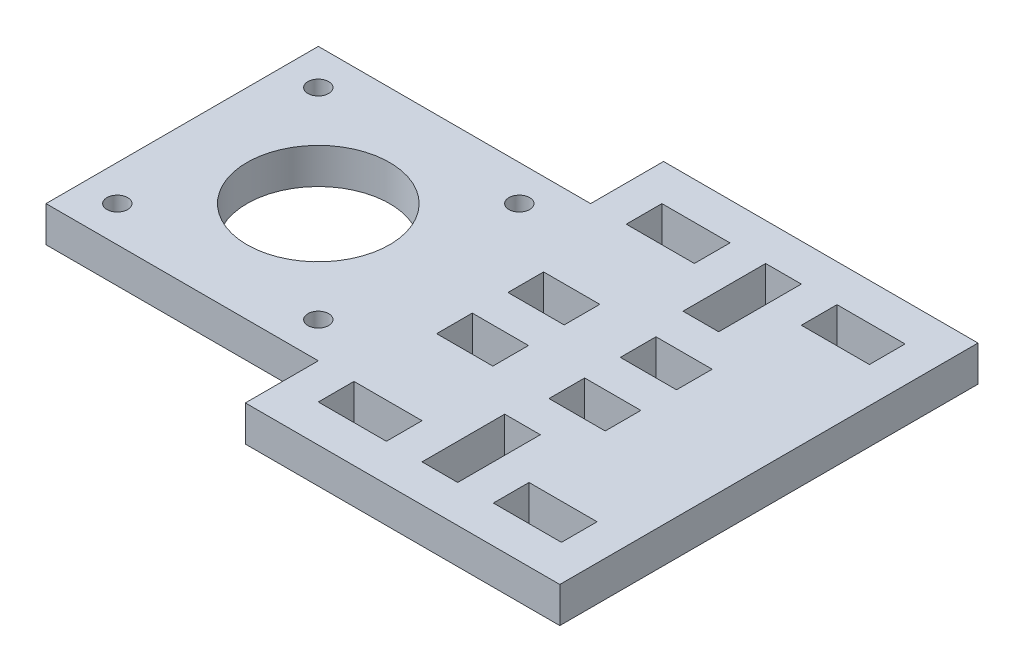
ISO-10303-21;
HEADER;
FILE_DESCRIPTION(('STEP AP214'),'2;1');
FILE_NAME('part.step','',(''),(''),'','','');
FILE_SCHEMA(('AUTOMOTIVE_DESIGN { 1 0 10303 214 1 1 1 1 }'));
ENDSEC;
DATA;
#1=APPLICATION_CONTEXT('core data for automotive mechanical design processes');
#2=APPLICATION_PROTOCOL_DEFINITION('international standard','automotive_design',2000,#1);
#3=PRODUCT_CONTEXT('',#1,'mechanical');
#4=PRODUCT('Part','Part','',(#3));
#5=PRODUCT_RELATED_PRODUCT_CATEGORY('part','',(#4));
#6=PRODUCT_DEFINITION_FORMATION('','',#4);
#7=PRODUCT_DEFINITION_CONTEXT('part definition',#1,'design');
#8=PRODUCT_DEFINITION('design','',#6,#7);
#9=PRODUCT_DEFINITION_SHAPE('','',#8);
#10=(LENGTH_UNIT() NAMED_UNIT(*) SI_UNIT(.MILLI.,.METRE.));
#11=(NAMED_UNIT(*) PLANE_ANGLE_UNIT() SI_UNIT($,.RADIAN.));
#12=(NAMED_UNIT(*) SI_UNIT($,.STERADIAN.) SOLID_ANGLE_UNIT());
#13=UNCERTAINTY_MEASURE_WITH_UNIT(LENGTH_MEASURE(1.E-05),#10,'distance_accuracy_value','');
#14=(GEOMETRIC_REPRESENTATION_CONTEXT(3) GLOBAL_UNCERTAINTY_ASSIGNED_CONTEXT((#13)) GLOBAL_UNIT_ASSIGNED_CONTEXT((#10,
#11,#12)) REPRESENTATION_CONTEXT('',''));
#15=CARTESIAN_POINT('',(0.,0.,0.));
#16=DIRECTION('',(0.,0.,1.));
#17=DIRECTION('',(1.,0.,0.));
#18=AXIS2_PLACEMENT_3D('',#15,#16,#17);
#19=CARTESIAN_POINT('',(0.,5.5,0.));
#20=DIRECTION('',(0.,1.,0.));
#21=DIRECTION('',(0.,0.,1.));
#22=AXIS2_PLACEMENT_3D('',#19,#20,#21);
#23=PLANE('',#22);
#24=CARTESIAN_POINT('',(-85.,5.5,-16.7500000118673));
#25=DIRECTION('',(0.,1.,0.));
#26=DIRECTION('',(0.,0.,1.));
#27=AXIS2_PLACEMENT_3D('',#24,#25,#26);
#28=CIRCLE('',#27,1.6);
#29=CARTESIAN_POINT('',(-85.,5.5,-15.1500000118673));
#30=VERTEX_POINT('',#29);
#31=EDGE_CURVE('E975',#30,#30,#28,.T.);
#32=ORIENTED_EDGE('',*,*,#31,.F.);
#33=EDGE_LOOP('',(#32));
#34=FACE_BOUND('',#33,.T.);
#35=CARTESIAN_POINT('',(-85.,5.5,-47.7499999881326));
#36=DIRECTION('',(0.,1.,0.));
#37=DIRECTION('',(0.,0.,1.));
#38=AXIS2_PLACEMENT_3D('',#35,#36,#37);
#39=CIRCLE('',#38,1.59999999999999);
#40=CARTESIAN_POINT('',(-85.,5.5,-46.1499999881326));
#41=VERTEX_POINT('',#40);
#42=EDGE_CURVE('E987',#41,#41,#39,.T.);
#43=ORIENTED_EDGE('',*,*,#42,.F.);
#44=EDGE_LOOP('',(#43));
#45=FACE_BOUND('',#44,.T.);
#46=DIRECTION('',(1.,0.,0.));
#47=VECTOR('',#46,1.);
#48=CARTESIAN_POINT('',(-34.3333333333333,5.5,-35.));
#49=LINE('',#48,#47);
#50=CARTESIAN_POINT('',(-43.,5.5,-35.));
#51=VERTEX_POINT('',#50);
#52=CARTESIAN_POINT('',(-34.3333333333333,5.5,-35.));
#53=VERTEX_POINT('',#52);
#54=EDGE_CURVE('E346',#51,#53,#49,.T.);
#55=ORIENTED_EDGE('',*,*,#54,.F.);
#56=DIRECTION('',(0.,0.,1.));
#57=VECTOR('',#56,1.);
#58=CARTESIAN_POINT('',(-43.,5.5,-35.));
#59=LINE('',#58,#57);
#60=CARTESIAN_POINT('',(-43.,5.5,-40.5));
#61=VERTEX_POINT('',#60);
#62=EDGE_CURVE('E338',#61,#51,#59,.T.);
#63=ORIENTED_EDGE('',*,*,#62,.F.);
#64=DIRECTION('',(-1.,0.,0.));
#65=VECTOR('',#64,1.);
#66=CARTESIAN_POINT('',(-43.,5.5,-40.5));
#67=LINE('',#66,#65);
#68=CARTESIAN_POINT('',(-34.3333333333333,5.5,-40.5));
#69=VERTEX_POINT('',#68);
#70=EDGE_CURVE('E361',#69,#61,#67,.T.);
#71=ORIENTED_EDGE('',*,*,#70,.F.);
#72=DIRECTION('',(0.,0.,-1.));
#73=VECTOR('',#72,1.);
#74=CARTESIAN_POINT('',(-34.3333333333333,5.5,-40.5));
#75=LINE('',#74,#73);
#76=EDGE_CURVE('E359',#53,#69,#75,.T.);
#77=ORIENTED_EDGE('',*,*,#76,.F.);
#78=EDGE_LOOP('',(#55,#63,#71,#77));
#79=FACE_BOUND('',#78,.T.);
#80=DIRECTION('',(-1.,0.,0.));
#81=VECTOR('',#80,1.);
#82=CARTESIAN_POINT('',(-25.6666666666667,5.5,-40.5));
#83=LINE('',#82,#81);
#84=CARTESIAN_POINT('',(-17.,5.5,-40.5));
#85=VERTEX_POINT('',#84);
#86=CARTESIAN_POINT('',(-25.6666666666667,5.5,-40.5));
#87=VERTEX_POINT('',#86);
#88=EDGE_CURVE('E379',#85,#87,#83,.T.);
#89=ORIENTED_EDGE('',*,*,#88,.F.);
#90=DIRECTION('',(0.,0.,-1.));
#91=VECTOR('',#90,1.);
#92=CARTESIAN_POINT('',(-17.,5.5,-40.5));
#93=LINE('',#92,#91);
#94=CARTESIAN_POINT('',(-17.,5.5,-35.));
#95=VERTEX_POINT('',#94);
#96=EDGE_CURVE('E377',#95,#85,#93,.T.);
#97=ORIENTED_EDGE('',*,*,#96,.F.);
#98=DIRECTION('',(1.,0.,0.));
#99=VECTOR('',#98,1.);
#100=CARTESIAN_POINT('',(-17.,5.5,-35.));
#101=LINE('',#100,#99);
#102=CARTESIAN_POINT('',(-25.6666666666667,5.5,-35.));
#103=VERTEX_POINT('',#102);
#104=EDGE_CURVE('E385',#103,#95,#101,.T.);
#105=ORIENTED_EDGE('',*,*,#104,.F.);
#106=DIRECTION('',(0.,0.,1.));
#107=VECTOR('',#106,1.);
#108=CARTESIAN_POINT('',(-25.6666666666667,5.5,-35.));
#109=LINE('',#108,#107);
#110=EDGE_CURVE('E382',#87,#103,#109,.T.);
#111=ORIENTED_EDGE('',*,*,#110,.F.);
#112=EDGE_LOOP('',(#89,#97,#105,#111));
#113=FACE_BOUND('',#112,.T.);
#114=DIRECTION('',(1.,0.,0.));
#115=VECTOR('',#114,1.);
#116=CARTESIAN_POINT('',(-34.3333333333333,5.5,-24.));
#117=LINE('',#116,#115);
#118=CARTESIAN_POINT('',(-43.,5.5,-24.));
#119=VERTEX_POINT('',#118);
#120=CARTESIAN_POINT('',(-34.3333333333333,5.5,-24.));
#121=VERTEX_POINT('',#120);
#122=EDGE_CURVE('E410',#119,#121,#117,.T.);
#123=ORIENTED_EDGE('',*,*,#122,.F.);
#124=DIRECTION('',(0.,0.,1.));
#125=VECTOR('',#124,1.);
#126=CARTESIAN_POINT('',(-43.,5.5,-24.));
#127=LINE('',#126,#125);
#128=CARTESIAN_POINT('',(-43.,5.5,-29.5));
#129=VERTEX_POINT('',#128);
#130=EDGE_CURVE('E408',#129,#119,#127,.T.);
#131=ORIENTED_EDGE('',*,*,#130,.F.);
#132=DIRECTION('',(-1.,0.,0.));
#133=VECTOR('',#132,1.);
#134=CARTESIAN_POINT('',(-43.,5.5,-29.5));
#135=LINE('',#134,#133);
#136=CARTESIAN_POINT('',(-34.3333333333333,5.5,-29.5));
#137=VERTEX_POINT('',#136);
#138=EDGE_CURVE('E416',#137,#129,#135,.T.);
#139=ORIENTED_EDGE('',*,*,#138,.F.);
#140=DIRECTION('',(0.,0.,-1.));
#141=VECTOR('',#140,1.);
#142=CARTESIAN_POINT('',(-34.3333333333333,5.5,-29.5));
#143=LINE('',#142,#141);
#144=EDGE_CURVE('E413',#121,#137,#143,.T.);
#145=ORIENTED_EDGE('',*,*,#144,.F.);
#146=EDGE_LOOP('',(#123,#131,#139,#145));
#147=FACE_BOUND('',#146,.T.);
#148=DIRECTION('',(0.,0.,-1.));
#149=VECTOR('',#148,1.);
#150=CARTESIAN_POINT('',(-17.,5.5,-29.5));
#151=LINE('',#150,#149);
#152=CARTESIAN_POINT('',(-17.,5.5,-24.));
#153=VERTEX_POINT('',#152);
#154=CARTESIAN_POINT('',(-17.,5.5,-29.5));
#155=VERTEX_POINT('',#154);
#156=EDGE_CURVE('E441',#153,#155,#151,.T.);
#157=ORIENTED_EDGE('',*,*,#156,.F.);
#158=DIRECTION('',(1.,0.,0.));
#159=VECTOR('',#158,1.);
#160=CARTESIAN_POINT('',(-17.,5.5,-24.));
#161=LINE('',#160,#159);
#162=CARTESIAN_POINT('',(-25.6666666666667,5.5,-24.));
#163=VERTEX_POINT('',#162);
#164=EDGE_CURVE('E439',#163,#153,#161,.T.);
#165=ORIENTED_EDGE('',*,*,#164,.F.);
#166=DIRECTION('',(0.,0.,1.));
#167=VECTOR('',#166,1.);
#168=CARTESIAN_POINT('',(-25.6666666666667,5.5,-24.));
#169=LINE('',#168,#167);
#170=CARTESIAN_POINT('',(-25.6666666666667,5.5,-29.5));
#171=VERTEX_POINT('',#170);
#172=EDGE_CURVE('E447',#171,#163,#169,.T.);
#173=ORIENTED_EDGE('',*,*,#172,.F.);
#174=DIRECTION('',(-1.,0.,0.));
#175=VECTOR('',#174,1.);
#176=CARTESIAN_POINT('',(-25.6666666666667,5.5,-29.5));
#177=LINE('',#176,#175);
#178=EDGE_CURVE('E444',#155,#171,#177,.T.);
#179=ORIENTED_EDGE('',*,*,#178,.F.);
#180=EDGE_LOOP('',(#157,#165,#173,#179));
#181=FACE_BOUND('',#180,.T.);
#182=DIRECTION('',(0.,0.,-1.));
#183=VECTOR('',#182,1.);
#184=CARTESIAN_POINT('',(-21.5,5.5,-18.5));
#185=LINE('',#184,#183);
#186=CARTESIAN_POINT('',(-21.5,5.5,-5.75));
#187=VERTEX_POINT('',#186);
#188=CARTESIAN_POINT('',(-21.5,5.5,-18.5));
#189=VERTEX_POINT('',#188);
#190=EDGE_CURVE('E472',#187,#189,#185,.T.);
#191=ORIENTED_EDGE('',*,*,#190,.F.);
#192=DIRECTION('',(1.,0.,0.));
#193=VECTOR('',#192,1.);
#194=CARTESIAN_POINT('',(-21.5,5.5,-5.75));
#195=LINE('',#194,#193);
#196=CARTESIAN_POINT('',(-27.,5.5,-5.75));
#197=VERTEX_POINT('',#196);
#198=EDGE_CURVE('E470',#197,#187,#195,.T.);
#199=ORIENTED_EDGE('',*,*,#198,.F.);
#200=DIRECTION('',(0.,0.,1.));
#201=VECTOR('',#200,1.);
#202=CARTESIAN_POINT('',(-27.,5.5,-5.75));
#203=LINE('',#202,#201);
#204=CARTESIAN_POINT('',(-27.,5.5,-18.5));
#205=VERTEX_POINT('',#204);
#206=EDGE_CURVE('E478',#205,#197,#203,.T.);
#207=ORIENTED_EDGE('',*,*,#206,.F.);
#208=DIRECTION('',(-1.,0.,0.));
#209=VECTOR('',#208,1.);
#210=CARTESIAN_POINT('',(-27.,5.5,-18.5));
#211=LINE('',#210,#209);
#212=EDGE_CURVE('E475',#189,#205,#211,.T.);
#213=ORIENTED_EDGE('',*,*,#212,.F.);
#214=EDGE_LOOP('',(#191,#199,#207,#213));
#215=FACE_BOUND('',#214,.T.);
#216=DIRECTION('',(0.,0.,1.));
#217=VECTOR('',#216,1.);
#218=CARTESIAN_POINT('',(-27.,5.5,-58.75));
#219=LINE('',#218,#217);
#220=CARTESIAN_POINT('',(-27.,5.5,-58.75));
#221=VERTEX_POINT('',#220);
#222=CARTESIAN_POINT('',(-27.,5.5,-46.));
#223=VERTEX_POINT('',#222);
#224=EDGE_CURVE('E503',#221,#223,#219,.T.);
#225=ORIENTED_EDGE('',*,*,#224,.F.);
#226=DIRECTION('',(-1.,0.,0.));
#227=VECTOR('',#226,1.);
#228=CARTESIAN_POINT('',(-21.5,5.5,-58.75));
#229=LINE('',#228,#227);
#230=CARTESIAN_POINT('',(-21.5,5.5,-58.75));
#231=VERTEX_POINT('',#230);
#232=EDGE_CURVE('E501',#231,#221,#229,.T.);
#233=ORIENTED_EDGE('',*,*,#232,.F.);
#234=DIRECTION('',(0.,0.,-1.));
#235=VECTOR('',#234,1.);
#236=CARTESIAN_POINT('',(-21.5,5.5,-46.));
#237=LINE('',#236,#235);
#238=CARTESIAN_POINT('',(-21.5,5.5,-46.));
#239=VERTEX_POINT('',#238);
#240=EDGE_CURVE('E509',#239,#231,#237,.T.);
#241=ORIENTED_EDGE('',*,*,#240,.F.);
#242=DIRECTION('',(1.,0.,0.));
#243=VECTOR('',#242,1.);
#244=CARTESIAN_POINT('',(-27.,5.5,-46.));
#245=LINE('',#244,#243);
#246=EDGE_CURVE('E506',#223,#239,#245,.T.);
#247=ORIENTED_EDGE('',*,*,#246,.F.);
#248=EDGE_LOOP('',(#225,#233,#241,#247));
#249=FACE_BOUND('',#248,.T.);
#250=DIRECTION('',(-1.,0.,0.));
#251=VECTOR('',#250,1.);
#252=CARTESIAN_POINT('',(-16.,5.5,-58.75));
#253=LINE('',#252,#251);
#254=CARTESIAN_POINT('',(-5.50000000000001,5.5,-58.75));
#255=VERTEX_POINT('',#254);
#256=CARTESIAN_POINT('',(-16.,5.5,-58.75));
#257=VERTEX_POINT('',#256);
#258=EDGE_CURVE('E534',#255,#257,#253,.T.);
#259=ORIENTED_EDGE('',*,*,#258,.F.);
#260=DIRECTION('',(0.,0.,-1.));
#261=VECTOR('',#260,1.);
#262=CARTESIAN_POINT('',(-5.50000000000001,5.5,-58.75));
#263=LINE('',#262,#261);
#264=CARTESIAN_POINT('',(-5.5,5.5,-53.25));
#265=VERTEX_POINT('',#264);
#266=EDGE_CURVE('E532',#265,#255,#263,.T.);
#267=ORIENTED_EDGE('',*,*,#266,.F.);
#268=DIRECTION('',(1.,0.,0.));
#269=VECTOR('',#268,1.);
#270=CARTESIAN_POINT('',(-5.5,5.5,-53.25));
#271=LINE('',#270,#269);
#272=CARTESIAN_POINT('',(-16.,5.5,-53.25));
#273=VERTEX_POINT('',#272);
#274=EDGE_CURVE('E540',#273,#265,#271,.T.);
#275=ORIENTED_EDGE('',*,*,#274,.F.);
#276=DIRECTION('',(0.,0.,1.));
#277=VECTOR('',#276,1.);
#278=CARTESIAN_POINT('',(-16.,5.5,-53.25));
#279=LINE('',#278,#277);
#280=EDGE_CURVE('E537',#257,#273,#279,.T.);
#281=ORIENTED_EDGE('',*,*,#280,.F.);
#282=EDGE_LOOP('',(#259,#267,#275,#281));
#283=FACE_BOUND('',#282,.T.);
#284=DIRECTION('',(1.,0.,0.));
#285=VECTOR('',#284,1.);
#286=CARTESIAN_POINT('',(-32.5,5.5,-53.25));
#287=LINE('',#286,#285);
#288=CARTESIAN_POINT('',(-43.,5.5,-53.25));
#289=VERTEX_POINT('',#288);
#290=CARTESIAN_POINT('',(-32.5,5.5,-53.25));
#291=VERTEX_POINT('',#290);
#292=EDGE_CURVE('E565',#289,#291,#287,.T.);
#293=ORIENTED_EDGE('',*,*,#292,.F.);
#294=DIRECTION('',(0.,0.,1.));
#295=VECTOR('',#294,1.);
#296=CARTESIAN_POINT('',(-43.,5.5,-53.25));
#297=LINE('',#296,#295);
#298=CARTESIAN_POINT('',(-43.,5.5,-58.75));
#299=VERTEX_POINT('',#298);
#300=EDGE_CURVE('E563',#299,#289,#297,.T.);
#301=ORIENTED_EDGE('',*,*,#300,.F.);
#302=DIRECTION('',(-1.,0.,0.));
#303=VECTOR('',#302,1.);
#304=CARTESIAN_POINT('',(-43.,5.5,-58.75));
#305=LINE('',#304,#303);
#306=CARTESIAN_POINT('',(-32.5,5.5,-58.75));
#307=VERTEX_POINT('',#306);
#308=EDGE_CURVE('E571',#307,#299,#305,.T.);
#309=ORIENTED_EDGE('',*,*,#308,.F.);
#310=DIRECTION('',(0.,0.,-1.));
#311=VECTOR('',#310,1.);
#312=CARTESIAN_POINT('',(-32.5,5.5,-58.75));
#313=LINE('',#312,#311);
#314=EDGE_CURVE('E568',#291,#307,#313,.T.);
#315=ORIENTED_EDGE('',*,*,#314,.F.);
#316=EDGE_LOOP('',(#293,#301,#309,#315));
#317=FACE_BOUND('',#316,.T.);
#318=DIRECTION('',(1.,0.,0.));
#319=VECTOR('',#318,1.);
#320=CARTESIAN_POINT('',(-32.5,5.5,-5.75));
#321=LINE('',#320,#319);
#322=CARTESIAN_POINT('',(-43.,5.5,-5.75));
#323=VERTEX_POINT('',#322);
#324=CARTESIAN_POINT('',(-32.5,5.5,-5.75));
#325=VERTEX_POINT('',#324);
#326=EDGE_CURVE('E596',#323,#325,#321,.T.);
#327=ORIENTED_EDGE('',*,*,#326,.F.);
#328=DIRECTION('',(0.,0.,1.));
#329=VECTOR('',#328,1.);
#330=CARTESIAN_POINT('',(-43.,5.5,-5.75));
#331=LINE('',#330,#329);
#332=CARTESIAN_POINT('',(-43.,5.5,-11.25));
#333=VERTEX_POINT('',#332);
#334=EDGE_CURVE('E594',#333,#323,#331,.T.);
#335=ORIENTED_EDGE('',*,*,#334,.F.);
#336=DIRECTION('',(-1.,0.,0.));
#337=VECTOR('',#336,1.);
#338=CARTESIAN_POINT('',(-43.,5.5,-11.25));
#339=LINE('',#338,#337);
#340=CARTESIAN_POINT('',(-32.5,5.5,-11.25));
#341=VERTEX_POINT('',#340);
#342=EDGE_CURVE('E602',#341,#333,#339,.T.);
#343=ORIENTED_EDGE('',*,*,#342,.F.);
#344=DIRECTION('',(0.,0.,-1.));
#345=VECTOR('',#344,1.);
#346=CARTESIAN_POINT('',(-32.5,5.5,-11.25));
#347=LINE('',#346,#345);
#348=EDGE_CURVE('E599',#325,#341,#347,.T.);
#349=ORIENTED_EDGE('',*,*,#348,.F.);
#350=EDGE_LOOP('',(#327,#335,#343,#349));
#351=FACE_BOUND('',#350,.T.);
#352=DIRECTION('',(-1.,0.,0.));
#353=VECTOR('',#352,1.);
#354=CARTESIAN_POINT('',(-16.,5.5,-11.25));
#355=LINE('',#354,#353);
#356=CARTESIAN_POINT('',(-5.5,5.5,-11.25));
#357=VERTEX_POINT('',#356);
#358=CARTESIAN_POINT('',(-16.,5.5,-11.25));
#359=VERTEX_POINT('',#358);
#360=EDGE_CURVE('E627',#357,#359,#355,.T.);
#361=ORIENTED_EDGE('',*,*,#360,.F.);
#362=DIRECTION('',(0.,0.,-1.));
#363=VECTOR('',#362,1.);
#364=CARTESIAN_POINT('',(-5.5,5.5,-11.25));
#365=LINE('',#364,#363);
#366=CARTESIAN_POINT('',(-5.50000000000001,5.5,-5.75));
#367=VERTEX_POINT('',#366);
#368=EDGE_CURVE('E625',#367,#357,#365,.T.);
#369=ORIENTED_EDGE('',*,*,#368,.F.);
#370=DIRECTION('',(1.,0.,0.));
#371=VECTOR('',#370,1.);
#372=CARTESIAN_POINT('',(-5.50000000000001,5.5,-5.75));
#373=LINE('',#372,#371);
#374=CARTESIAN_POINT('',(-16.,5.5,-5.75));
#375=VERTEX_POINT('',#374);
#376=EDGE_CURVE('E633',#375,#367,#373,.T.);
#377=ORIENTED_EDGE('',*,*,#376,.F.);
#378=DIRECTION('',(0.,0.,1.));
#379=VECTOR('',#378,1.);
#380=CARTESIAN_POINT('',(-16.,5.5,-5.75));
#381=LINE('',#380,#379);
#382=EDGE_CURVE('E630',#359,#375,#381,.T.);
#383=ORIENTED_EDGE('',*,*,#382,.F.);
#384=EDGE_LOOP('',(#361,#369,#377,#383));
#385=FACE_BOUND('',#384,.T.);
#386=DIRECTION('',(1.,0.,0.));
#387=VECTOR('',#386,1.);
#388=CARTESIAN_POINT('',(0.,5.5,0.));
#389=LINE('',#388,#387);
#390=CARTESIAN_POINT('',(-48.5000000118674,5.5,0.));
#391=VERTEX_POINT('',#390);
#392=CARTESIAN_POINT('',(0.,5.5,0.));
#393=VERTEX_POINT('',#392);
#394=EDGE_CURVE('E656',#391,#393,#389,.T.);
#395=ORIENTED_EDGE('',*,*,#394,.T.);
#396=DIRECTION('',(0.,0.,-1.));
#397=VECTOR('',#396,1.);
#398=CARTESIAN_POINT('',(0.,5.5,-64.5));
#399=LINE('',#398,#397);
#400=CARTESIAN_POINT('',(0.,5.5,-64.5));
#401=VERTEX_POINT('',#400);
#402=EDGE_CURVE('E659',#393,#401,#399,.T.);
#403=ORIENTED_EDGE('',*,*,#402,.T.);
#404=DIRECTION('',(-1.,0.,0.));
#405=VECTOR('',#404,1.);
#406=CARTESIAN_POINT('',(-48.5000000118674,5.5,-64.5));
#407=LINE('',#406,#405);
#408=CARTESIAN_POINT('',(-48.5000000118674,5.5,-64.5));
#409=VERTEX_POINT('',#408);
#410=EDGE_CURVE('E662',#401,#409,#407,.T.);
#411=ORIENTED_EDGE('',*,*,#410,.T.);
#412=DIRECTION('',(0.,0.,1.));
#413=VECTOR('',#412,1.);
#414=CARTESIAN_POINT('',(-48.5000000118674,5.5,-64.5));
#415=LINE('',#414,#413);
#416=CARTESIAN_POINT('',(-48.5000000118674,5.5,-53.25));
#417=VERTEX_POINT('',#416);
#418=EDGE_CURVE('E664',#409,#417,#415,.T.);
#419=ORIENTED_EDGE('',*,*,#418,.T.);
#420=DIRECTION('',(-1.,0.,0.));
#421=VECTOR('',#420,1.);
#422=CARTESIAN_POINT('',(-48.5000000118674,5.5,-53.25));
#423=LINE('',#422,#421);
#424=CARTESIAN_POINT('',(-90.5000000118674,5.5,-53.25));
#425=VERTEX_POINT('',#424);
#426=EDGE_CURVE('E666',#417,#425,#423,.T.);
#427=ORIENTED_EDGE('',*,*,#426,.T.);
#428=DIRECTION('',(0.,0.,1.));
#429=VECTOR('',#428,1.);
#430=CARTESIAN_POINT('',(-90.5000000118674,5.5,-53.25));
#431=LINE('',#430,#429);
#432=CARTESIAN_POINT('',(-90.5000000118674,5.5,-11.25));
#433=VERTEX_POINT('',#432);
#434=EDGE_CURVE('E668',#425,#433,#431,.T.);
#435=ORIENTED_EDGE('',*,*,#434,.T.);
#436=DIRECTION('',(1.,0.,0.));
#437=VECTOR('',#436,1.);
#438=CARTESIAN_POINT('',(-90.5000000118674,5.5,-11.25));
#439=LINE('',#438,#437);
#440=CARTESIAN_POINT('',(-48.5000000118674,5.5,-11.25));
#441=VERTEX_POINT('',#440);
#442=EDGE_CURVE('E670',#433,#441,#439,.T.);
#443=ORIENTED_EDGE('',*,*,#442,.T.);
#444=DIRECTION('',(0.,0.,1.));
#445=VECTOR('',#444,1.);
#446=CARTESIAN_POINT('',(-48.5000000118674,5.5,-11.25));
#447=LINE('',#446,#445);
#448=EDGE_CURVE('E672',#441,#391,#447,.T.);
#449=ORIENTED_EDGE('',*,*,#448,.T.);
#450=EDGE_LOOP('',(#395,#403,#411,#419,#427,#435,#443,#449));
#451=FACE_BOUND('',#450,.T.);
#452=CARTESIAN_POINT('',(-69.5000000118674,5.5,-32.25));
#453=DIRECTION('',(0.,1.,0.));
#454=DIRECTION('',(0.,0.,1.));
#455=AXIS2_PLACEMENT_3D('',#452,#453,#454);
#456=CIRCLE('',#455,11.);
#457=CARTESIAN_POINT('',(-69.5000000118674,5.5,-21.25));
#458=VERTEX_POINT('',#457);
#459=EDGE_CURVE('E367',#458,#458,#456,.T.);
#460=ORIENTED_EDGE('',*,*,#459,.F.);
#461=EDGE_LOOP('',(#460));
#462=FACE_BOUND('',#461,.T.);
#463=CARTESIAN_POINT('',(-54.0000000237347,5.5,-47.7499999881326));
#464=DIRECTION('',(0.,1.,0.));
#465=DIRECTION('',(0.,0.,1.));
#466=AXIS2_PLACEMENT_3D('',#463,#464,#465);
#467=CIRCLE('',#466,1.60000000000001);
#468=CARTESIAN_POINT('',(-54.0000000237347,5.5,-46.1499999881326));
#469=VERTEX_POINT('',#468);
#470=EDGE_CURVE('E981',#469,#469,#467,.T.);
#471=ORIENTED_EDGE('',*,*,#470,.F.);
#472=EDGE_LOOP('',(#471));
#473=FACE_BOUND('',#472,.T.);
#474=CARTESIAN_POINT('',(-54.0000000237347,5.5,-16.7500000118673));
#475=DIRECTION('',(0.,1.,0.));
#476=DIRECTION('',(0.,0.,1.));
#477=AXIS2_PLACEMENT_3D('',#474,#475,#476);
#478=CIRCLE('',#477,1.6);
#479=CARTESIAN_POINT('',(-54.0000000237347,5.5,-15.1500000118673));
#480=VERTEX_POINT('',#479);
#481=EDGE_CURVE('E966',#480,#480,#478,.T.);
#482=ORIENTED_EDGE('',*,*,#481,.F.);
#483=EDGE_LOOP('',(#482));
#484=FACE_BOUND('',#483,.T.);
#485=ADVANCED_FACE('F33',(#34,#45,#79,#113,#147,#181,#215,#249,#283,#317,#351,#385,#451,#462,
#473,#484),#23,.T.);
#486=CARTESIAN_POINT('',(0.,0.,0.));
#487=DIRECTION('',(0.,1.,0.));
#488=DIRECTION('',(0.,0.,1.));
#489=AXIS2_PLACEMENT_3D('',#486,#487,#488);
#490=PLANE('',#489);
#491=DIRECTION('',(0.,0.,-1.));
#492=VECTOR('',#491,1.);
#493=CARTESIAN_POINT('',(-17.,0.,-40.5));
#494=LINE('',#493,#492);
#495=CARTESIAN_POINT('',(-17.,0.,-35.));
#496=VERTEX_POINT('',#495);
#497=CARTESIAN_POINT('',(-17.,0.,-40.5));
#498=VERTEX_POINT('',#497);
#499=EDGE_CURVE('E354',#496,#498,#494,.T.);
#500=ORIENTED_EDGE('',*,*,#499,.T.);
#501=DIRECTION('',(-1.,0.,0.));
#502=VECTOR('',#501,1.);
#503=CARTESIAN_POINT('',(-25.6666666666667,0.,-40.5));
#504=LINE('',#503,#502);
#505=CARTESIAN_POINT('',(-25.6666666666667,0.,-40.5));
#506=VERTEX_POINT('',#505);
#507=EDGE_CURVE('E390',#498,#506,#504,.T.);
#508=ORIENTED_EDGE('',*,*,#507,.T.);
#509=DIRECTION('',(0.,0.,1.));
#510=VECTOR('',#509,1.);
#511=CARTESIAN_POINT('',(-25.6666666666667,0.,-35.));
#512=LINE('',#511,#510);
#513=CARTESIAN_POINT('',(-25.6666666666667,0.,-35.));
#514=VERTEX_POINT('',#513);
#515=EDGE_CURVE('E393',#506,#514,#512,.T.);
#516=ORIENTED_EDGE('',*,*,#515,.T.);
#517=DIRECTION('',(1.,0.,0.));
#518=VECTOR('',#517,1.);
#519=CARTESIAN_POINT('',(-17.,0.,-35.));
#520=LINE('',#519,#518);
#521=EDGE_CURVE('E380',#514,#496,#520,.T.);
#522=ORIENTED_EDGE('',*,*,#521,.T.);
#523=EDGE_LOOP('',(#500,#508,#516,#522));
#524=FACE_BOUND('',#523,.T.);
#525=DIRECTION('',(1.,0.,0.));
#526=VECTOR('',#525,1.);
#527=CARTESIAN_POINT('',(-17.,0.,-24.));
#528=LINE('',#527,#526);
#529=CARTESIAN_POINT('',(-25.6666666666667,0.,-24.));
#530=VERTEX_POINT('',#529);
#531=CARTESIAN_POINT('',(-17.,0.,-24.));
#532=VERTEX_POINT('',#531);
#533=EDGE_CURVE('E438',#530,#532,#528,.T.);
#534=ORIENTED_EDGE('',*,*,#533,.T.);
#535=DIRECTION('',(0.,0.,-1.));
#536=VECTOR('',#535,1.);
#537=CARTESIAN_POINT('',(-17.,0.,-29.5));
#538=LINE('',#537,#536);
#539=CARTESIAN_POINT('',(-17.,0.,-29.5));
#540=VERTEX_POINT('',#539);
#541=EDGE_CURVE('E452',#532,#540,#538,.T.);
#542=ORIENTED_EDGE('',*,*,#541,.T.);
#543=DIRECTION('',(-1.,0.,0.));
#544=VECTOR('',#543,1.);
#545=CARTESIAN_POINT('',(-25.6666666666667,0.,-29.5));
#546=LINE('',#545,#544);
#547=CARTESIAN_POINT('',(-25.6666666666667,0.,-29.5));
#548=VERTEX_POINT('',#547);
#549=EDGE_CURVE('E455',#540,#548,#546,.T.);
#550=ORIENTED_EDGE('',*,*,#549,.T.);
#551=DIRECTION('',(0.,0.,1.));
#552=VECTOR('',#551,1.);
#553=CARTESIAN_POINT('',(-25.6666666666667,0.,-24.));
#554=LINE('',#553,#552);
#555=EDGE_CURVE('E442',#548,#530,#554,.T.);
#556=ORIENTED_EDGE('',*,*,#555,.T.);
#557=EDGE_LOOP('',(#534,#542,#550,#556));
#558=FACE_BOUND('',#557,.T.);
#559=DIRECTION('',(-1.,0.,0.));
#560=VECTOR('',#559,1.);
#561=CARTESIAN_POINT('',(-21.5,0.,-58.75));
#562=LINE('',#561,#560);
#563=CARTESIAN_POINT('',(-21.5,0.,-58.75));
#564=VERTEX_POINT('',#563);
#565=CARTESIAN_POINT('',(-27.,0.,-58.75));
#566=VERTEX_POINT('',#565);
#567=EDGE_CURVE('E500',#564,#566,#562,.T.);
#568=ORIENTED_EDGE('',*,*,#567,.T.);
#569=DIRECTION('',(0.,0.,1.));
#570=VECTOR('',#569,1.);
#571=CARTESIAN_POINT('',(-27.,0.,-58.75));
#572=LINE('',#571,#570);
#573=CARTESIAN_POINT('',(-27.,0.,-46.));
#574=VERTEX_POINT('',#573);
#575=EDGE_CURVE('E514',#566,#574,#572,.T.);
#576=ORIENTED_EDGE('',*,*,#575,.T.);
#577=DIRECTION('',(1.,0.,0.));
#578=VECTOR('',#577,1.);
#579=CARTESIAN_POINT('',(-27.,0.,-46.));
#580=LINE('',#579,#578);
#581=CARTESIAN_POINT('',(-21.5,0.,-46.));
#582=VERTEX_POINT('',#581);
#583=EDGE_CURVE('E517',#574,#582,#580,.T.);
#584=ORIENTED_EDGE('',*,*,#583,.T.);
#585=DIRECTION('',(0.,0.,-1.));
#586=VECTOR('',#585,1.);
#587=CARTESIAN_POINT('',(-21.5,0.,-46.));
#588=LINE('',#587,#586);
#589=EDGE_CURVE('E504',#582,#564,#588,.T.);
#590=ORIENTED_EDGE('',*,*,#589,.T.);
#591=EDGE_LOOP('',(#568,#576,#584,#590));
#592=FACE_BOUND('',#591,.T.);
#593=DIRECTION('',(0.,0.,1.));
#594=VECTOR('',#593,1.);
#595=CARTESIAN_POINT('',(-43.,0.,-53.25));
#596=LINE('',#595,#594);
#597=CARTESIAN_POINT('',(-43.,0.,-58.75));
#598=VERTEX_POINT('',#597);
#599=CARTESIAN_POINT('',(-43.,0.,-53.25));
#600=VERTEX_POINT('',#599);
#601=EDGE_CURVE('E562',#598,#600,#596,.T.);
#602=ORIENTED_EDGE('',*,*,#601,.T.);
#603=DIRECTION('',(1.,0.,0.));
#604=VECTOR('',#603,1.);
#605=CARTESIAN_POINT('',(-32.5,0.,-53.25));
#606=LINE('',#605,#604);
#607=CARTESIAN_POINT('',(-32.5,0.,-53.25));
#608=VERTEX_POINT('',#607);
#609=EDGE_CURVE('E576',#600,#608,#606,.T.);
#610=ORIENTED_EDGE('',*,*,#609,.T.);
#611=DIRECTION('',(0.,0.,-1.));
#612=VECTOR('',#611,1.);
#613=CARTESIAN_POINT('',(-32.5,0.,-58.75));
#614=LINE('',#613,#612);
#615=CARTESIAN_POINT('',(-32.5,0.,-58.75));
#616=VERTEX_POINT('',#615);
#617=EDGE_CURVE('E579',#608,#616,#614,.T.);
#618=ORIENTED_EDGE('',*,*,#617,.T.);
#619=DIRECTION('',(-1.,0.,0.));
#620=VECTOR('',#619,1.);
#621=CARTESIAN_POINT('',(-43.,0.,-58.75));
#622=LINE('',#621,#620);
#623=EDGE_CURVE('E566',#616,#598,#622,.T.);
#624=ORIENTED_EDGE('',*,*,#623,.T.);
#625=EDGE_LOOP('',(#602,#610,#618,#624));
#626=FACE_BOUND('',#625,.T.);
#627=DIRECTION('',(0.,0.,-1.));
#628=VECTOR('',#627,1.);
#629=CARTESIAN_POINT('',(-5.5,0.,-11.25));
#630=LINE('',#629,#628);
#631=CARTESIAN_POINT('',(-5.50000000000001,0.,-5.75));
#632=VERTEX_POINT('',#631);
#633=CARTESIAN_POINT('',(-5.5,0.,-11.25));
#634=VERTEX_POINT('',#633);
#635=EDGE_CURVE('E624',#632,#634,#630,.T.);
#636=ORIENTED_EDGE('',*,*,#635,.T.);
#637=DIRECTION('',(-1.,0.,0.));
#638=VECTOR('',#637,1.);
#639=CARTESIAN_POINT('',(-16.,0.,-11.25));
#640=LINE('',#639,#638);
#641=CARTESIAN_POINT('',(-16.,0.,-11.25));
#642=VERTEX_POINT('',#641);
#643=EDGE_CURVE('E638',#634,#642,#640,.T.);
#644=ORIENTED_EDGE('',*,*,#643,.T.);
#645=DIRECTION('',(0.,0.,1.));
#646=VECTOR('',#645,1.);
#647=CARTESIAN_POINT('',(-16.,0.,-5.75));
#648=LINE('',#647,#646);
#649=CARTESIAN_POINT('',(-16.,0.,-5.75));
#650=VERTEX_POINT('',#649);
#651=EDGE_CURVE('E641',#642,#650,#648,.T.);
#652=ORIENTED_EDGE('',*,*,#651,.T.);
#653=DIRECTION('',(1.,0.,0.));
#654=VECTOR('',#653,1.);
#655=CARTESIAN_POINT('',(-5.50000000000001,0.,-5.75));
#656=LINE('',#655,#654);
#657=EDGE_CURVE('E628',#650,#632,#656,.T.);
#658=ORIENTED_EDGE('',*,*,#657,.T.);
#659=EDGE_LOOP('',(#636,#644,#652,#658));
#660=FACE_BOUND('',#659,.T.);
#661=DIRECTION('',(1.,0.,0.));
#662=VECTOR('',#661,1.);
#663=CARTESIAN_POINT('',(0.,0.,0.));
#664=LINE('',#663,#662);
#665=CARTESIAN_POINT('',(-48.5000000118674,0.,0.));
#666=VERTEX_POINT('',#665);
#667=CARTESIAN_POINT('',(0.,0.,0.));
#668=VERTEX_POINT('',#667);
#669=EDGE_CURVE('E655',#666,#668,#664,.T.);
#670=ORIENTED_EDGE('',*,*,#669,.F.);
#671=DIRECTION('',(0.,0.,1.));
#672=VECTOR('',#671,1.);
#673=CARTESIAN_POINT('',(-48.5000000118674,0.,-11.25));
#674=LINE('',#673,#672);
#675=CARTESIAN_POINT('',(-48.5000000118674,0.,-11.25));
#676=VERTEX_POINT('',#675);
#677=EDGE_CURVE('E660',#676,#666,#674,.T.);
#678=ORIENTED_EDGE('',*,*,#677,.F.);
#679=DIRECTION('',(1.,0.,0.));
#680=VECTOR('',#679,1.);
#681=CARTESIAN_POINT('',(-90.5000000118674,0.,-11.25));
#682=LINE('',#681,#680);
#683=CARTESIAN_POINT('',(-90.5000000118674,0.,-11.25));
#684=VERTEX_POINT('',#683);
#685=EDGE_CURVE('E687',#684,#676,#682,.T.);
#686=ORIENTED_EDGE('',*,*,#685,.F.);
#687=DIRECTION('',(0.,0.,1.));
#688=VECTOR('',#687,1.);
#689=CARTESIAN_POINT('',(-90.5000000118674,0.,-53.25));
#690=LINE('',#689,#688);
#691=CARTESIAN_POINT('',(-90.5000000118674,0.,-53.25));
#692=VERTEX_POINT('',#691);
#693=EDGE_CURVE('E685',#692,#684,#690,.T.);
#694=ORIENTED_EDGE('',*,*,#693,.F.);
#695=DIRECTION('',(-1.,0.,0.));
#696=VECTOR('',#695,1.);
#697=CARTESIAN_POINT('',(-48.5000000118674,0.,-53.25));
#698=LINE('',#697,#696);
#699=CARTESIAN_POINT('',(-48.5000000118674,0.,-53.25));
#700=VERTEX_POINT('',#699);
#701=EDGE_CURVE('E683',#700,#692,#698,.T.);
#702=ORIENTED_EDGE('',*,*,#701,.F.);
#703=DIRECTION('',(0.,0.,1.));
#704=VECTOR('',#703,1.);
#705=CARTESIAN_POINT('',(-48.5000000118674,0.,-64.5));
#706=LINE('',#705,#704);
#707=CARTESIAN_POINT('',(-48.5000000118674,0.,-64.5));
#708=VERTEX_POINT('',#707);
#709=EDGE_CURVE('E681',#708,#700,#706,.T.);
#710=ORIENTED_EDGE('',*,*,#709,.F.);
#711=DIRECTION('',(-1.,0.,0.));
#712=VECTOR('',#711,1.);
#713=CARTESIAN_POINT('',(-48.5000000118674,0.,-64.5));
#714=LINE('',#713,#712);
#715=CARTESIAN_POINT('',(0.,0.,-64.5));
#716=VERTEX_POINT('',#715);
#717=EDGE_CURVE('E679',#716,#708,#714,.T.);
#718=ORIENTED_EDGE('',*,*,#717,.F.);
#719=DIRECTION('',(0.,0.,-1.));
#720=VECTOR('',#719,1.);
#721=CARTESIAN_POINT('',(0.,0.,-64.5));
#722=LINE('',#721,#720);
#723=EDGE_CURVE('E677',#668,#716,#722,.T.);
#724=ORIENTED_EDGE('',*,*,#723,.F.);
#725=EDGE_LOOP('',(#670,#678,#686,#694,#702,#710,#718,#724));
#726=FACE_BOUND('',#725,.T.);
#727=DIRECTION('',(0.,0.,1.));
#728=VECTOR('',#727,1.);
#729=CARTESIAN_POINT('',(-43.,0.,-5.75));
#730=LINE('',#729,#728);
#731=CARTESIAN_POINT('',(-43.,0.,-11.25));
#732=VERTEX_POINT('',#731);
#733=CARTESIAN_POINT('',(-43.,0.,-5.75));
#734=VERTEX_POINT('',#733);
#735=EDGE_CURVE('E593',#732,#734,#730,.T.);
#736=ORIENTED_EDGE('',*,*,#735,.T.);
#737=DIRECTION('',(1.,0.,0.));
#738=VECTOR('',#737,1.);
#739=CARTESIAN_POINT('',(-32.5,0.,-5.75));
#740=LINE('',#739,#738);
#741=CARTESIAN_POINT('',(-32.5,0.,-5.75));
#742=VERTEX_POINT('',#741);
#743=EDGE_CURVE('E607',#734,#742,#740,.T.);
#744=ORIENTED_EDGE('',*,*,#743,.T.);
#745=DIRECTION('',(0.,0.,-1.));
#746=VECTOR('',#745,1.);
#747=CARTESIAN_POINT('',(-32.5,0.,-11.25));
#748=LINE('',#747,#746);
#749=CARTESIAN_POINT('',(-32.5,0.,-11.25));
#750=VERTEX_POINT('',#749);
#751=EDGE_CURVE('E610',#742,#750,#748,.T.);
#752=ORIENTED_EDGE('',*,*,#751,.T.);
#753=DIRECTION('',(-1.,0.,0.));
#754=VECTOR('',#753,1.);
#755=CARTESIAN_POINT('',(-43.,0.,-11.25));
#756=LINE('',#755,#754);
#757=EDGE_CURVE('E597',#750,#732,#756,.T.);
#758=ORIENTED_EDGE('',*,*,#757,.T.);
#759=EDGE_LOOP('',(#736,#744,#752,#758));
#760=FACE_BOUND('',#759,.T.);
#761=DIRECTION('',(0.,0.,-1.));
#762=VECTOR('',#761,1.);
#763=CARTESIAN_POINT('',(-5.50000000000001,0.,-58.75));
#764=LINE('',#763,#762);
#765=CARTESIAN_POINT('',(-5.5,0.,-53.25));
#766=VERTEX_POINT('',#765);
#767=CARTESIAN_POINT('',(-5.50000000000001,0.,-58.75));
#768=VERTEX_POINT('',#767);
#769=EDGE_CURVE('E531',#766,#768,#764,.T.);
#770=ORIENTED_EDGE('',*,*,#769,.T.);
#771=DIRECTION('',(-1.,0.,0.));
#772=VECTOR('',#771,1.);
#773=CARTESIAN_POINT('',(-16.,0.,-58.75));
#774=LINE('',#773,#772);
#775=CARTESIAN_POINT('',(-16.,0.,-58.75));
#776=VERTEX_POINT('',#775);
#777=EDGE_CURVE('E545',#768,#776,#774,.T.);
#778=ORIENTED_EDGE('',*,*,#777,.T.);
#779=DIRECTION('',(0.,0.,1.));
#780=VECTOR('',#779,1.);
#781=CARTESIAN_POINT('',(-16.,0.,-53.25));
#782=LINE('',#781,#780);
#783=CARTESIAN_POINT('',(-16.,0.,-53.25));
#784=VERTEX_POINT('',#783);
#785=EDGE_CURVE('E548',#776,#784,#782,.T.);
#786=ORIENTED_EDGE('',*,*,#785,.T.);
#787=DIRECTION('',(1.,0.,0.));
#788=VECTOR('',#787,1.);
#789=CARTESIAN_POINT('',(-5.5,0.,-53.25));
#790=LINE('',#789,#788);
#791=EDGE_CURVE('E535',#784,#766,#790,.T.);
#792=ORIENTED_EDGE('',*,*,#791,.T.);
#793=EDGE_LOOP('',(#770,#778,#786,#792));
#794=FACE_BOUND('',#793,.T.);
#795=DIRECTION('',(1.,0.,0.));
#796=VECTOR('',#795,1.);
#797=CARTESIAN_POINT('',(-21.5,0.,-5.75));
#798=LINE('',#797,#796);
#799=CARTESIAN_POINT('',(-27.,0.,-5.75));
#800=VERTEX_POINT('',#799);
#801=CARTESIAN_POINT('',(-21.5,0.,-5.75));
#802=VERTEX_POINT('',#801);
#803=EDGE_CURVE('E469',#800,#802,#798,.T.);
#804=ORIENTED_EDGE('',*,*,#803,.T.);
#805=DIRECTION('',(0.,0.,-1.));
#806=VECTOR('',#805,1.);
#807=CARTESIAN_POINT('',(-21.5,0.,-18.5));
#808=LINE('',#807,#806);
#809=CARTESIAN_POINT('',(-21.5,0.,-18.5));
#810=VERTEX_POINT('',#809);
#811=EDGE_CURVE('E483',#802,#810,#808,.T.);
#812=ORIENTED_EDGE('',*,*,#811,.T.);
#813=DIRECTION('',(-1.,0.,0.));
#814=VECTOR('',#813,1.);
#815=CARTESIAN_POINT('',(-27.,0.,-18.5));
#816=LINE('',#815,#814);
#817=CARTESIAN_POINT('',(-27.,0.,-18.5));
#818=VERTEX_POINT('',#817);
#819=EDGE_CURVE('E486',#810,#818,#816,.T.);
#820=ORIENTED_EDGE('',*,*,#819,.T.);
#821=DIRECTION('',(0.,0.,1.));
#822=VECTOR('',#821,1.);
#823=CARTESIAN_POINT('',(-27.,0.,-5.75));
#824=LINE('',#823,#822);
#825=EDGE_CURVE('E473',#818,#800,#824,.T.);
#826=ORIENTED_EDGE('',*,*,#825,.T.);
#827=EDGE_LOOP('',(#804,#812,#820,#826));
#828=FACE_BOUND('',#827,.T.);
#829=DIRECTION('',(0.,0.,1.));
#830=VECTOR('',#829,1.);
#831=CARTESIAN_POINT('',(-43.,0.,-24.));
#832=LINE('',#831,#830);
#833=CARTESIAN_POINT('',(-43.,0.,-29.5));
#834=VERTEX_POINT('',#833);
#835=CARTESIAN_POINT('',(-43.,0.,-24.));
#836=VERTEX_POINT('',#835);
#837=EDGE_CURVE('E407',#834,#836,#832,.T.);
#838=ORIENTED_EDGE('',*,*,#837,.T.);
#839=DIRECTION('',(1.,0.,0.));
#840=VECTOR('',#839,1.);
#841=CARTESIAN_POINT('',(-34.3333333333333,0.,-24.));
#842=LINE('',#841,#840);
#843=CARTESIAN_POINT('',(-34.3333333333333,0.,-24.));
#844=VERTEX_POINT('',#843);
#845=EDGE_CURVE('E421',#836,#844,#842,.T.);
#846=ORIENTED_EDGE('',*,*,#845,.T.);
#847=DIRECTION('',(0.,0.,-1.));
#848=VECTOR('',#847,1.);
#849=CARTESIAN_POINT('',(-34.3333333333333,0.,-29.5));
#850=LINE('',#849,#848);
#851=CARTESIAN_POINT('',(-34.3333333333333,0.,-29.5));
#852=VERTEX_POINT('',#851);
#853=EDGE_CURVE('E424',#844,#852,#850,.T.);
#854=ORIENTED_EDGE('',*,*,#853,.T.);
#855=DIRECTION('',(-1.,0.,0.));
#856=VECTOR('',#855,1.);
#857=CARTESIAN_POINT('',(-43.,0.,-29.5));
#858=LINE('',#857,#856);
#859=EDGE_CURVE('E411',#852,#834,#858,.T.);
#860=ORIENTED_EDGE('',*,*,#859,.T.);
#861=EDGE_LOOP('',(#838,#846,#854,#860));
#862=FACE_BOUND('',#861,.T.);
#863=DIRECTION('',(0.,0.,1.));
#864=VECTOR('',#863,1.);
#865=CARTESIAN_POINT('',(-43.,0.,-35.));
#866=LINE('',#865,#864);
#867=CARTESIAN_POINT('',(-43.,0.,-40.5));
#868=VERTEX_POINT('',#867);
#869=CARTESIAN_POINT('',(-43.,0.,-35.));
#870=VERTEX_POINT('',#869);
#871=EDGE_CURVE('E56',#868,#870,#866,.T.);
#872=ORIENTED_EDGE('',*,*,#871,.T.);
#873=DIRECTION('',(1.,0.,0.));
#874=VECTOR('',#873,1.);
#875=CARTESIAN_POINT('',(-34.3333333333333,0.,-35.));
#876=LINE('',#875,#874);
#877=CARTESIAN_POINT('',(-34.3333333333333,0.,-35.));
#878=VERTEX_POINT('',#877);
#879=EDGE_CURVE('E353',#870,#878,#876,.T.);
#880=ORIENTED_EDGE('',*,*,#879,.T.);
#881=DIRECTION('',(0.,0.,-1.));
#882=VECTOR('',#881,1.);
#883=CARTESIAN_POINT('',(-34.3333333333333,0.,-40.5));
#884=LINE('',#883,#882);
#885=CARTESIAN_POINT('',(-34.3333333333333,0.,-40.5));
#886=VERTEX_POINT('',#885);
#887=EDGE_CURVE('E369',#878,#886,#884,.T.);
#888=ORIENTED_EDGE('',*,*,#887,.T.);
#889=DIRECTION('',(-1.,0.,0.));
#890=VECTOR('',#889,1.);
#891=CARTESIAN_POINT('',(-43.,0.,-40.5));
#892=LINE('',#891,#890);
#893=EDGE_CURVE('E347',#886,#868,#892,.T.);
#894=ORIENTED_EDGE('',*,*,#893,.T.);
#895=EDGE_LOOP('',(#872,#880,#888,#894));
#896=FACE_BOUND('',#895,.T.);
#897=CARTESIAN_POINT('',(-69.5000000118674,0.,-32.25));
#898=DIRECTION('',(0.,1.,0.));
#899=DIRECTION('',(0.,0.,1.));
#900=AXIS2_PLACEMENT_3D('',#897,#898,#899);
#901=CIRCLE('',#900,11.);
#902=CARTESIAN_POINT('',(-69.5000000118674,0.,-21.25));
#903=VERTEX_POINT('',#902);
#904=EDGE_CURVE('E990',#903,#903,#901,.T.);
#905=ORIENTED_EDGE('',*,*,#904,.T.);
#906=EDGE_LOOP('',(#905));
#907=FACE_BOUND('',#906,.T.);
#908=CARTESIAN_POINT('',(-85.,0.,-47.7499999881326));
#909=DIRECTION('',(0.,1.,0.));
#910=DIRECTION('',(0.,0.,1.));
#911=AXIS2_PLACEMENT_3D('',#908,#909,#910);
#912=CIRCLE('',#911,1.59999999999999);
#913=CARTESIAN_POINT('',(-85.,0.,-46.1499999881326));
#914=VERTEX_POINT('',#913);
#915=EDGE_CURVE('E984',#914,#914,#912,.T.);
#916=ORIENTED_EDGE('',*,*,#915,.T.);
#917=EDGE_LOOP('',(#916));
#918=FACE_BOUND('',#917,.T.);
#919=CARTESIAN_POINT('',(-54.0000000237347,0.,-47.7499999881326));
#920=DIRECTION('',(0.,1.,0.));
#921=DIRECTION('',(0.,0.,1.));
#922=AXIS2_PLACEMENT_3D('',#919,#920,#921);
#923=CIRCLE('',#922,1.60000000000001);
#924=CARTESIAN_POINT('',(-54.0000000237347,0.,-46.1499999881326));
#925=VERTEX_POINT('',#924);
#926=EDGE_CURVE('E978',#925,#925,#923,.T.);
#927=ORIENTED_EDGE('',*,*,#926,.T.);
#928=EDGE_LOOP('',(#927));
#929=FACE_BOUND('',#928,.T.);
#930=CARTESIAN_POINT('',(-85.,0.,-16.7500000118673));
#931=DIRECTION('',(0.,1.,0.));
#932=DIRECTION('',(0.,0.,1.));
#933=AXIS2_PLACEMENT_3D('',#930,#931,#932);
#934=CIRCLE('',#933,1.6);
#935=CARTESIAN_POINT('',(-85.,0.,-15.1500000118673));
#936=VERTEX_POINT('',#935);
#937=EDGE_CURVE('E972',#936,#936,#934,.T.);
#938=ORIENTED_EDGE('',*,*,#937,.T.);
#939=EDGE_LOOP('',(#938));
#940=FACE_BOUND('',#939,.T.);
#941=CARTESIAN_POINT('',(-54.0000000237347,0.,-16.7500000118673));
#942=DIRECTION('',(0.,1.,0.));
#943=DIRECTION('',(0.,0.,1.));
#944=AXIS2_PLACEMENT_3D('',#941,#942,#943);
#945=CIRCLE('',#944,1.6);
#946=CARTESIAN_POINT('',(-54.0000000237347,0.,-15.1500000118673));
#947=VERTEX_POINT('',#946);
#948=EDGE_CURVE('E969',#947,#947,#945,.T.);
#949=ORIENTED_EDGE('',*,*,#948,.T.);
#950=EDGE_LOOP('',(#949));
#951=FACE_BOUND('',#950,.T.);
#952=ADVANCED_FACE('F717',(#524,#558,#592,#626,#660,#726,#760,#794,#828,#862,#896,#907,#918,
#929,#940,#951),#490,.F.);
#953=CARTESIAN_POINT('',(0.,5.5,0.));
#954=DIRECTION('',(0.,0.,-1.));
#955=DIRECTION('',(-1.,0.,0.));
#956=AXIS2_PLACEMENT_3D('',#953,#954,#955);
#957=PLANE('',#956);
#958=ORIENTED_EDGE('',*,*,#669,.T.);
#959=DIRECTION('',(0.,-1.,0.));
#960=VECTOR('',#959,1.);
#961=CARTESIAN_POINT('',(0.,5.5,0.));
#962=LINE('',#961,#960);
#963=EDGE_CURVE('E11',#393,#668,#962,.T.);
#964=ORIENTED_EDGE('',*,*,#963,.F.);
#965=ORIENTED_EDGE('',*,*,#394,.F.);
#966=DIRECTION('',(0.,-1.,0.));
#967=VECTOR('',#966,1.);
#968=CARTESIAN_POINT('',(-48.5000000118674,5.5,0.));
#969=LINE('',#968,#967);
#970=EDGE_CURVE('E674',#391,#666,#969,.T.);
#971=ORIENTED_EDGE('',*,*,#970,.T.);
#972=EDGE_LOOP('',(#958,#964,#965,#971));
#973=FACE_BOUND('',#972,.T.);
#974=ADVANCED_FACE('F35',(#973),#957,.F.);
#975=CARTESIAN_POINT('',(0.,5.5,-64.5));
#976=DIRECTION('',(-1.,0.,0.));
#977=DIRECTION('',(0.,0.,1.));
#978=AXIS2_PLACEMENT_3D('',#975,#976,#977);
#979=PLANE('',#978);
#980=ORIENTED_EDGE('',*,*,#723,.T.);
#981=DIRECTION('',(0.,-1.,0.));
#982=VECTOR('',#981,1.);
#983=CARTESIAN_POINT('',(0.,5.5,-64.5));
#984=LINE('',#983,#982);
#985=EDGE_CURVE('E41',#401,#716,#984,.T.);
#986=ORIENTED_EDGE('',*,*,#985,.F.);
#987=ORIENTED_EDGE('',*,*,#402,.F.);
#988=ORIENTED_EDGE('',*,*,#963,.T.);
#989=EDGE_LOOP('',(#980,#986,#987,#988));
#990=FACE_BOUND('',#989,.T.);
#991=ADVANCED_FACE('F735',(#990),#979,.F.);
#992=CARTESIAN_POINT('',(-48.5000000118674,5.5,-64.5));
#993=DIRECTION('',(0.,0.,1.));
#994=DIRECTION('',(1.,0.,0.));
#995=AXIS2_PLACEMENT_3D('',#992,#993,#994);
#996=PLANE('',#995);
#997=ORIENTED_EDGE('',*,*,#717,.T.);
#998=DIRECTION('',(0.,-1.,0.));
#999=VECTOR('',#998,1.);
#1000=CARTESIAN_POINT('',(-48.5000000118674,5.5,-64.5));
#1001=LINE('',#1000,#999);
#1002=EDGE_CURVE('E704',#409,#708,#1001,.T.);
#1003=ORIENTED_EDGE('',*,*,#1002,.F.);
#1004=ORIENTED_EDGE('',*,*,#410,.F.);
#1005=ORIENTED_EDGE('',*,*,#985,.T.);
#1006=EDGE_LOOP('',(#997,#1003,#1004,#1005));
#1007=FACE_BOUND('',#1006,.T.);
#1008=ADVANCED_FACE('F711',(#1007),#996,.F.);
#1009=CARTESIAN_POINT('',(-48.5000000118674,5.5,-64.5));
#1010=DIRECTION('',(1.,0.,0.));
#1011=DIRECTION('',(0.,0.,-1.));
#1012=AXIS2_PLACEMENT_3D('',#1009,#1010,#1011);
#1013=PLANE('',#1012);
#1014=ORIENTED_EDGE('',*,*,#709,.T.);
#1015=DIRECTION('',(0.,-1.,0.));
#1016=VECTOR('',#1015,1.);
#1017=CARTESIAN_POINT('',(-48.5000000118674,5.5,-53.25));
#1018=LINE('',#1017,#1016);
#1019=EDGE_CURVE('E701',#417,#700,#1018,.T.);
#1020=ORIENTED_EDGE('',*,*,#1019,.F.);
#1021=ORIENTED_EDGE('',*,*,#418,.F.);
#1022=ORIENTED_EDGE('',*,*,#1002,.T.);
#1023=EDGE_LOOP('',(#1014,#1020,#1021,#1022));
#1024=FACE_BOUND('',#1023,.T.);
#1025=ADVANCED_FACE('F723',(#1024),#1013,.F.);
#1026=CARTESIAN_POINT('',(-48.5000000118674,5.5,-53.25));
#1027=DIRECTION('',(0.,0.,1.));
#1028=DIRECTION('',(1.,0.,0.));
#1029=AXIS2_PLACEMENT_3D('',#1026,#1027,#1028);
#1030=PLANE('',#1029);
#1031=ORIENTED_EDGE('',*,*,#701,.T.);
#1032=DIRECTION('',(0.,-1.,0.));
#1033=VECTOR('',#1032,1.);
#1034=CARTESIAN_POINT('',(-90.5000000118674,5.5,-53.25));
#1035=LINE('',#1034,#1033);
#1036=EDGE_CURVE('E698',#425,#692,#1035,.T.);
#1037=ORIENTED_EDGE('',*,*,#1036,.F.);
#1038=ORIENTED_EDGE('',*,*,#426,.F.);
#1039=ORIENTED_EDGE('',*,*,#1019,.T.);
#1040=EDGE_LOOP('',(#1031,#1037,#1038,#1039));
#1041=FACE_BOUND('',#1040,.T.);
#1042=ADVANCED_FACE('F727',(#1041),#1030,.F.);
#1043=CARTESIAN_POINT('',(-90.5000000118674,5.5,-53.25));
#1044=DIRECTION('',(1.,0.,0.));
#1045=DIRECTION('',(0.,0.,-1.));
#1046=AXIS2_PLACEMENT_3D('',#1043,#1044,#1045);
#1047=PLANE('',#1046);
#1048=ORIENTED_EDGE('',*,*,#693,.T.);
#1049=DIRECTION('',(0.,-1.,0.));
#1050=VECTOR('',#1049,1.);
#1051=CARTESIAN_POINT('',(-90.5000000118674,5.5,-11.25));
#1052=LINE('',#1051,#1050);
#1053=EDGE_CURVE('E695',#433,#684,#1052,.T.);
#1054=ORIENTED_EDGE('',*,*,#1053,.F.);
#1055=ORIENTED_EDGE('',*,*,#434,.F.);
#1056=ORIENTED_EDGE('',*,*,#1036,.T.);
#1057=EDGE_LOOP('',(#1048,#1054,#1055,#1056));
#1058=FACE_BOUND('',#1057,.T.);
#1059=ADVANCED_FACE('F748',(#1058),#1047,.F.);
#1060=CARTESIAN_POINT('',(-90.5000000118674,5.5,-11.25));
#1061=DIRECTION('',(0.,0.,-1.));
#1062=DIRECTION('',(-1.,0.,0.));
#1063=AXIS2_PLACEMENT_3D('',#1060,#1061,#1062);
#1064=PLANE('',#1063);
#1065=ORIENTED_EDGE('',*,*,#685,.T.);
#1066=DIRECTION('',(0.,-1.,0.));
#1067=VECTOR('',#1066,1.);
#1068=CARTESIAN_POINT('',(-48.5000000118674,5.5,-11.25));
#1069=LINE('',#1068,#1067);
#1070=EDGE_CURVE('E692',#441,#676,#1069,.T.);
#1071=ORIENTED_EDGE('',*,*,#1070,.F.);
#1072=ORIENTED_EDGE('',*,*,#442,.F.);
#1073=ORIENTED_EDGE('',*,*,#1053,.T.);
#1074=EDGE_LOOP('',(#1065,#1071,#1072,#1073));
#1075=FACE_BOUND('',#1074,.T.);
#1076=ADVANCED_FACE('F746',(#1075),#1064,.F.);
#1077=CARTESIAN_POINT('',(-48.5000000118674,5.5,-11.25));
#1078=DIRECTION('',(1.,0.,0.));
#1079=DIRECTION('',(0.,0.,-1.));
#1080=AXIS2_PLACEMENT_3D('',#1077,#1078,#1079);
#1081=PLANE('',#1080);
#1082=ORIENTED_EDGE('',*,*,#677,.T.);
#1083=ORIENTED_EDGE('',*,*,#970,.F.);
#1084=ORIENTED_EDGE('',*,*,#448,.F.);
#1085=ORIENTED_EDGE('',*,*,#1070,.T.);
#1086=EDGE_LOOP('',(#1082,#1083,#1084,#1085));
#1087=FACE_BOUND('',#1086,.T.);
#1088=ADVANCED_FACE('F741',(#1087),#1081,.F.);
#1089=CARTESIAN_POINT('',(-5.5,5.5,-11.25));
#1090=DIRECTION('',(-1.,0.,0.));
#1091=DIRECTION('',(0.,0.,1.));
#1092=AXIS2_PLACEMENT_3D('',#1089,#1090,#1091);
#1093=PLANE('',#1092);
#1094=ORIENTED_EDGE('',*,*,#635,.F.);
#1095=DIRECTION('',(0.,-1.,0.));
#1096=VECTOR('',#1095,1.);
#1097=CARTESIAN_POINT('',(-5.50000000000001,5.5,-5.75));
#1098=LINE('',#1097,#1096);
#1099=EDGE_CURVE('E635',#367,#632,#1098,.T.);
#1100=ORIENTED_EDGE('',*,*,#1099,.F.);
#1101=ORIENTED_EDGE('',*,*,#368,.T.);
#1102=DIRECTION('',(0.,-1.,0.));
#1103=VECTOR('',#1102,1.);
#1104=CARTESIAN_POINT('',(-5.5,5.5,-11.25));
#1105=LINE('',#1104,#1103);
#1106=EDGE_CURVE('E652',#357,#634,#1105,.T.);
#1107=ORIENTED_EDGE('',*,*,#1106,.T.);
#1108=EDGE_LOOP('',(#1094,#1100,#1101,#1107));
#1109=FACE_BOUND('',#1108,.T.);
#1110=ADVANCED_FACE('F768',(#1109),#1093,.T.);
#1111=CARTESIAN_POINT('',(-16.,5.5,-11.25));
#1112=DIRECTION('',(0.,0.,1.));
#1113=DIRECTION('',(1.,0.,0.));
#1114=AXIS2_PLACEMENT_3D('',#1111,#1112,#1113);
#1115=PLANE('',#1114);
#1116=ORIENTED_EDGE('',*,*,#643,.F.);
#1117=ORIENTED_EDGE('',*,*,#1106,.F.);
#1118=ORIENTED_EDGE('',*,*,#360,.T.);
#1119=DIRECTION('',(0.,-1.,0.));
#1120=VECTOR('',#1119,1.);
#1121=CARTESIAN_POINT('',(-16.,5.5,-11.25));
#1122=LINE('',#1121,#1120);
#1123=EDGE_CURVE('E650',#359,#642,#1122,.T.);
#1124=ORIENTED_EDGE('',*,*,#1123,.T.);
#1125=EDGE_LOOP('',(#1116,#1117,#1118,#1124));
#1126=FACE_BOUND('',#1125,.T.);
#1127=ADVANCED_FACE('F775',(#1126),#1115,.T.);
#1128=CARTESIAN_POINT('',(-16.,5.5,-5.75));
#1129=DIRECTION('',(1.,0.,0.));
#1130=DIRECTION('',(0.,0.,-1.));
#1131=AXIS2_PLACEMENT_3D('',#1128,#1129,#1130);
#1132=PLANE('',#1131);
#1133=ORIENTED_EDGE('',*,*,#651,.F.);
#1134=ORIENTED_EDGE('',*,*,#1123,.F.);
#1135=ORIENTED_EDGE('',*,*,#382,.T.);
#1136=DIRECTION('',(0.,-1.,0.));
#1137=VECTOR('',#1136,1.);
#1138=CARTESIAN_POINT('',(-16.,5.5,-5.75));
#1139=LINE('',#1138,#1137);
#1140=EDGE_CURVE('E648',#375,#650,#1139,.T.);
#1141=ORIENTED_EDGE('',*,*,#1140,.T.);
#1142=EDGE_LOOP('',(#1133,#1134,#1135,#1141));
#1143=FACE_BOUND('',#1142,.T.);
#1144=ADVANCED_FACE('F780',(#1143),#1132,.T.);
#1145=CARTESIAN_POINT('',(-5.50000000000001,5.5,-5.75));
#1146=DIRECTION('',(0.,0.,-1.));
#1147=DIRECTION('',(-1.,0.,0.));
#1148=AXIS2_PLACEMENT_3D('',#1145,#1146,#1147);
#1149=PLANE('',#1148);
#1150=ORIENTED_EDGE('',*,*,#657,.F.);
#1151=ORIENTED_EDGE('',*,*,#1140,.F.);
#1152=ORIENTED_EDGE('',*,*,#376,.T.);
#1153=ORIENTED_EDGE('',*,*,#1099,.T.);
#1154=EDGE_LOOP('',(#1150,#1151,#1152,#1153));
#1155=FACE_BOUND('',#1154,.T.);
#1156=ADVANCED_FACE('F788',(#1155),#1149,.T.);
#1157=CARTESIAN_POINT('',(-43.,5.5,-5.75));
#1158=DIRECTION('',(1.,0.,0.));
#1159=DIRECTION('',(0.,0.,-1.));
#1160=AXIS2_PLACEMENT_3D('',#1157,#1158,#1159);
#1161=PLANE('',#1160);
#1162=ORIENTED_EDGE('',*,*,#735,.F.);
#1163=DIRECTION('',(0.,-1.,0.));
#1164=VECTOR('',#1163,1.);
#1165=CARTESIAN_POINT('',(-43.,5.5,-11.25));
#1166=LINE('',#1165,#1164);
#1167=EDGE_CURVE('E604',#333,#732,#1166,.T.);
#1168=ORIENTED_EDGE('',*,*,#1167,.F.);
#1169=ORIENTED_EDGE('',*,*,#334,.T.);
#1170=DIRECTION('',(0.,-1.,0.));
#1171=VECTOR('',#1170,1.);
#1172=CARTESIAN_POINT('',(-43.,5.5,-5.75));
#1173=LINE('',#1172,#1171);
#1174=EDGE_CURVE('E621',#323,#734,#1173,.T.);
#1175=ORIENTED_EDGE('',*,*,#1174,.T.);
#1176=EDGE_LOOP('',(#1162,#1168,#1169,#1175));
#1177=FACE_BOUND('',#1176,.T.);
#1178=ADVANCED_FACE('F801',(#1177),#1161,.T.);
#1179=CARTESIAN_POINT('',(-32.5,5.5,-5.75));
#1180=DIRECTION('',(0.,0.,-1.));
#1181=DIRECTION('',(-1.,0.,0.));
#1182=AXIS2_PLACEMENT_3D('',#1179,#1180,#1181);
#1183=PLANE('',#1182);
#1184=ORIENTED_EDGE('',*,*,#743,.F.);
#1185=ORIENTED_EDGE('',*,*,#1174,.F.);
#1186=ORIENTED_EDGE('',*,*,#326,.T.);
#1187=DIRECTION('',(0.,-1.,0.));
#1188=VECTOR('',#1187,1.);
#1189=CARTESIAN_POINT('',(-32.5,5.5,-5.75));
#1190=LINE('',#1189,#1188);
#1191=EDGE_CURVE('E619',#325,#742,#1190,.T.);
#1192=ORIENTED_EDGE('',*,*,#1191,.T.);
#1193=EDGE_LOOP('',(#1184,#1185,#1186,#1192));
#1194=FACE_BOUND('',#1193,.T.);
#1195=ADVANCED_FACE('F806',(#1194),#1183,.T.);
#1196=CARTESIAN_POINT('',(-32.5,5.5,-11.25));
#1197=DIRECTION('',(-1.,0.,0.));
#1198=DIRECTION('',(0.,0.,1.));
#1199=AXIS2_PLACEMENT_3D('',#1196,#1197,#1198);
#1200=PLANE('',#1199);
#1201=ORIENTED_EDGE('',*,*,#751,.F.);
#1202=ORIENTED_EDGE('',*,*,#1191,.F.);
#1203=ORIENTED_EDGE('',*,*,#348,.T.);
#1204=DIRECTION('',(0.,-1.,0.));
#1205=VECTOR('',#1204,1.);
#1206=CARTESIAN_POINT('',(-32.5,5.5,-11.25));
#1207=LINE('',#1206,#1205);
#1208=EDGE_CURVE('E617',#341,#750,#1207,.T.);
#1209=ORIENTED_EDGE('',*,*,#1208,.T.);
#1210=EDGE_LOOP('',(#1201,#1202,#1203,#1209));
#1211=FACE_BOUND('',#1210,.T.);
#1212=ADVANCED_FACE('F810',(#1211),#1200,.T.);
#1213=CARTESIAN_POINT('',(-43.,5.5,-11.25));
#1214=DIRECTION('',(0.,0.,1.));
#1215=DIRECTION('',(1.,0.,0.));
#1216=AXIS2_PLACEMENT_3D('',#1213,#1214,#1215);
#1217=PLANE('',#1216);
#1218=ORIENTED_EDGE('',*,*,#757,.F.);
#1219=ORIENTED_EDGE('',*,*,#1208,.F.);
#1220=ORIENTED_EDGE('',*,*,#342,.T.);
#1221=ORIENTED_EDGE('',*,*,#1167,.T.);
#1222=EDGE_LOOP('',(#1218,#1219,#1220,#1221));
#1223=FACE_BOUND('',#1222,.T.);
#1224=ADVANCED_FACE('F814',(#1223),#1217,.T.);
#1225=CARTESIAN_POINT('',(-43.,5.5,-53.25));
#1226=DIRECTION('',(1.,0.,0.));
#1227=DIRECTION('',(0.,0.,-1.));
#1228=AXIS2_PLACEMENT_3D('',#1225,#1226,#1227);
#1229=PLANE('',#1228);
#1230=ORIENTED_EDGE('',*,*,#601,.F.);
#1231=DIRECTION('',(0.,-1.,0.));
#1232=VECTOR('',#1231,1.);
#1233=CARTESIAN_POINT('',(-43.,5.5,-58.75));
#1234=LINE('',#1233,#1232);
#1235=EDGE_CURVE('E573',#299,#598,#1234,.T.);
#1236=ORIENTED_EDGE('',*,*,#1235,.F.);
#1237=ORIENTED_EDGE('',*,*,#300,.T.);
#1238=DIRECTION('',(0.,-1.,0.));
#1239=VECTOR('',#1238,1.);
#1240=CARTESIAN_POINT('',(-43.,5.5,-53.25));
#1241=LINE('',#1240,#1239);
#1242=EDGE_CURVE('E590',#289,#600,#1241,.T.);
#1243=ORIENTED_EDGE('',*,*,#1242,.T.);
#1244=EDGE_LOOP('',(#1230,#1236,#1237,#1243));
#1245=FACE_BOUND('',#1244,.T.);
#1246=ADVANCED_FACE('F818',(#1245),#1229,.T.);
#1247=CARTESIAN_POINT('',(-32.5,5.5,-53.25));
#1248=DIRECTION('',(0.,0.,-1.));
#1249=DIRECTION('',(-1.,0.,0.));
#1250=AXIS2_PLACEMENT_3D('',#1247,#1248,#1249);
#1251=PLANE('',#1250);
#1252=ORIENTED_EDGE('',*,*,#609,.F.);
#1253=ORIENTED_EDGE('',*,*,#1242,.F.);
#1254=ORIENTED_EDGE('',*,*,#292,.T.);
#1255=DIRECTION('',(0.,-1.,0.));
#1256=VECTOR('',#1255,1.);
#1257=CARTESIAN_POINT('',(-32.5,5.5,-53.25));
#1258=LINE('',#1257,#1256);
#1259=EDGE_CURVE('E588',#291,#608,#1258,.T.);
#1260=ORIENTED_EDGE('',*,*,#1259,.T.);
#1261=EDGE_LOOP('',(#1252,#1253,#1254,#1260));
#1262=FACE_BOUND('',#1261,.T.);
#1263=ADVANCED_FACE('F822',(#1262),#1251,.T.);
#1264=CARTESIAN_POINT('',(-32.5,5.5,-58.75));
#1265=DIRECTION('',(-1.,0.,0.));
#1266=DIRECTION('',(0.,0.,1.));
#1267=AXIS2_PLACEMENT_3D('',#1264,#1265,#1266);
#1268=PLANE('',#1267);
#1269=ORIENTED_EDGE('',*,*,#617,.F.);
#1270=ORIENTED_EDGE('',*,*,#1259,.F.);
#1271=ORIENTED_EDGE('',*,*,#314,.T.);
#1272=DIRECTION('',(0.,-1.,0.));
#1273=VECTOR('',#1272,1.);
#1274=CARTESIAN_POINT('',(-32.5,5.5,-58.75));
#1275=LINE('',#1274,#1273);
#1276=EDGE_CURVE('E586',#307,#616,#1275,.T.);
#1277=ORIENTED_EDGE('',*,*,#1276,.T.);
#1278=EDGE_LOOP('',(#1269,#1270,#1271,#1277));
#1279=FACE_BOUND('',#1278,.T.);
#1280=ADVANCED_FACE('F826',(#1279),#1268,.T.);
#1281=CARTESIAN_POINT('',(-43.,5.5,-58.75));
#1282=DIRECTION('',(0.,0.,1.));
#1283=DIRECTION('',(1.,0.,0.));
#1284=AXIS2_PLACEMENT_3D('',#1281,#1282,#1283);
#1285=PLANE('',#1284);
#1286=ORIENTED_EDGE('',*,*,#623,.F.);
#1287=ORIENTED_EDGE('',*,*,#1276,.F.);
#1288=ORIENTED_EDGE('',*,*,#308,.T.);
#1289=ORIENTED_EDGE('',*,*,#1235,.T.);
#1290=EDGE_LOOP('',(#1286,#1287,#1288,#1289));
#1291=FACE_BOUND('',#1290,.T.);
#1292=ADVANCED_FACE('F830',(#1291),#1285,.T.);
#1293=CARTESIAN_POINT('',(-5.50000000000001,5.5,-58.75));
#1294=DIRECTION('',(-1.,0.,0.));
#1295=DIRECTION('',(0.,0.,1.));
#1296=AXIS2_PLACEMENT_3D('',#1293,#1294,#1295);
#1297=PLANE('',#1296);
#1298=ORIENTED_EDGE('',*,*,#769,.F.);
#1299=DIRECTION('',(0.,-1.,0.));
#1300=VECTOR('',#1299,1.);
#1301=CARTESIAN_POINT('',(-5.5,5.5,-53.25));
#1302=LINE('',#1301,#1300);
#1303=EDGE_CURVE('E542',#265,#766,#1302,.T.);
#1304=ORIENTED_EDGE('',*,*,#1303,.F.);
#1305=ORIENTED_EDGE('',*,*,#266,.T.);
#1306=DIRECTION('',(0.,-1.,0.));
#1307=VECTOR('',#1306,1.);
#1308=CARTESIAN_POINT('',(-5.50000000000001,5.5,-58.75));
#1309=LINE('',#1308,#1307);
#1310=EDGE_CURVE('E559',#255,#768,#1309,.T.);
#1311=ORIENTED_EDGE('',*,*,#1310,.T.);
#1312=EDGE_LOOP('',(#1298,#1304,#1305,#1311));
#1313=FACE_BOUND('',#1312,.T.);
#1314=ADVANCED_FACE('F834',(#1313),#1297,.T.);
#1315=CARTESIAN_POINT('',(-16.,5.5,-58.75));
#1316=DIRECTION('',(0.,0.,1.));
#1317=DIRECTION('',(1.,0.,0.));
#1318=AXIS2_PLACEMENT_3D('',#1315,#1316,#1317);
#1319=PLANE('',#1318);
#1320=ORIENTED_EDGE('',*,*,#777,.F.);
#1321=ORIENTED_EDGE('',*,*,#1310,.F.);
#1322=ORIENTED_EDGE('',*,*,#258,.T.);
#1323=DIRECTION('',(0.,-1.,0.));
#1324=VECTOR('',#1323,1.);
#1325=CARTESIAN_POINT('',(-16.,5.5,-58.75));
#1326=LINE('',#1325,#1324);
#1327=EDGE_CURVE('E557',#257,#776,#1326,.T.);
#1328=ORIENTED_EDGE('',*,*,#1327,.T.);
#1329=EDGE_LOOP('',(#1320,#1321,#1322,#1328));
#1330=FACE_BOUND('',#1329,.T.);
#1331=ADVANCED_FACE('F838',(#1330),#1319,.T.);
#1332=CARTESIAN_POINT('',(-16.,5.5,-53.25));
#1333=DIRECTION('',(1.,0.,0.));
#1334=DIRECTION('',(0.,0.,-1.));
#1335=AXIS2_PLACEMENT_3D('',#1332,#1333,#1334);
#1336=PLANE('',#1335);
#1337=ORIENTED_EDGE('',*,*,#785,.F.);
#1338=ORIENTED_EDGE('',*,*,#1327,.F.);
#1339=ORIENTED_EDGE('',*,*,#280,.T.);
#1340=DIRECTION('',(0.,-1.,0.));
#1341=VECTOR('',#1340,1.);
#1342=CARTESIAN_POINT('',(-16.,5.5,-53.25));
#1343=LINE('',#1342,#1341);
#1344=EDGE_CURVE('E555',#273,#784,#1343,.T.);
#1345=ORIENTED_EDGE('',*,*,#1344,.T.);
#1346=EDGE_LOOP('',(#1337,#1338,#1339,#1345));
#1347=FACE_BOUND('',#1346,.T.);
#1348=ADVANCED_FACE('F842',(#1347),#1336,.T.);
#1349=CARTESIAN_POINT('',(-5.5,5.5,-53.25));
#1350=DIRECTION('',(0.,0.,-1.));
#1351=DIRECTION('',(-1.,0.,0.));
#1352=AXIS2_PLACEMENT_3D('',#1349,#1350,#1351);
#1353=PLANE('',#1352);
#1354=ORIENTED_EDGE('',*,*,#791,.F.);
#1355=ORIENTED_EDGE('',*,*,#1344,.F.);
#1356=ORIENTED_EDGE('',*,*,#274,.T.);
#1357=ORIENTED_EDGE('',*,*,#1303,.T.);
#1358=EDGE_LOOP('',(#1354,#1355,#1356,#1357));
#1359=FACE_BOUND('',#1358,.T.);
#1360=ADVANCED_FACE('F846',(#1359),#1353,.T.);
#1361=CARTESIAN_POINT('',(-21.5,5.5,-58.75));
#1362=DIRECTION('',(0.,0.,1.));
#1363=DIRECTION('',(1.,0.,0.));
#1364=AXIS2_PLACEMENT_3D('',#1361,#1362,#1363);
#1365=PLANE('',#1364);
#1366=ORIENTED_EDGE('',*,*,#567,.F.);
#1367=DIRECTION('',(0.,-1.,0.));
#1368=VECTOR('',#1367,1.);
#1369=CARTESIAN_POINT('',(-21.5,5.5,-58.75));
#1370=LINE('',#1369,#1368);
#1371=EDGE_CURVE('E511',#231,#564,#1370,.T.);
#1372=ORIENTED_EDGE('',*,*,#1371,.F.);
#1373=ORIENTED_EDGE('',*,*,#232,.T.);
#1374=DIRECTION('',(0.,-1.,0.));
#1375=VECTOR('',#1374,1.);
#1376=CARTESIAN_POINT('',(-27.,5.5,-58.75));
#1377=LINE('',#1376,#1375);
#1378=EDGE_CURVE('E528',#221,#566,#1377,.T.);
#1379=ORIENTED_EDGE('',*,*,#1378,.T.);
#1380=EDGE_LOOP('',(#1366,#1372,#1373,#1379));
#1381=FACE_BOUND('',#1380,.T.);
#1382=ADVANCED_FACE('F850',(#1381),#1365,.T.);
#1383=CARTESIAN_POINT('',(-27.,5.5,-58.75));
#1384=DIRECTION('',(1.,0.,0.));
#1385=DIRECTION('',(0.,0.,-1.));
#1386=AXIS2_PLACEMENT_3D('',#1383,#1384,#1385);
#1387=PLANE('',#1386);
#1388=ORIENTED_EDGE('',*,*,#575,.F.);
#1389=ORIENTED_EDGE('',*,*,#1378,.F.);
#1390=ORIENTED_EDGE('',*,*,#224,.T.);
#1391=DIRECTION('',(0.,-1.,0.));
#1392=VECTOR('',#1391,1.);
#1393=CARTESIAN_POINT('',(-27.,5.5,-46.));
#1394=LINE('',#1393,#1392);
#1395=EDGE_CURVE('E526',#223,#574,#1394,.T.);
#1396=ORIENTED_EDGE('',*,*,#1395,.T.);
#1397=EDGE_LOOP('',(#1388,#1389,#1390,#1396));
#1398=FACE_BOUND('',#1397,.T.);
#1399=ADVANCED_FACE('F854',(#1398),#1387,.T.);
#1400=CARTESIAN_POINT('',(-27.,5.5,-46.));
#1401=DIRECTION('',(0.,0.,-1.));
#1402=DIRECTION('',(-1.,0.,0.));
#1403=AXIS2_PLACEMENT_3D('',#1400,#1401,#1402);
#1404=PLANE('',#1403);
#1405=ORIENTED_EDGE('',*,*,#583,.F.);
#1406=ORIENTED_EDGE('',*,*,#1395,.F.);
#1407=ORIENTED_EDGE('',*,*,#246,.T.);
#1408=DIRECTION('',(0.,-1.,0.));
#1409=VECTOR('',#1408,1.);
#1410=CARTESIAN_POINT('',(-21.5,5.5,-46.));
#1411=LINE('',#1410,#1409);
#1412=EDGE_CURVE('E524',#239,#582,#1411,.T.);
#1413=ORIENTED_EDGE('',*,*,#1412,.T.);
#1414=EDGE_LOOP('',(#1405,#1406,#1407,#1413));
#1415=FACE_BOUND('',#1414,.T.);
#1416=ADVANCED_FACE('F858',(#1415),#1404,.T.);
#1417=CARTESIAN_POINT('',(-21.5,5.5,-46.));
#1418=DIRECTION('',(-1.,0.,0.));
#1419=DIRECTION('',(0.,0.,1.));
#1420=AXIS2_PLACEMENT_3D('',#1417,#1418,#1419);
#1421=PLANE('',#1420);
#1422=ORIENTED_EDGE('',*,*,#589,.F.);
#1423=ORIENTED_EDGE('',*,*,#1412,.F.);
#1424=ORIENTED_EDGE('',*,*,#240,.T.);
#1425=ORIENTED_EDGE('',*,*,#1371,.T.);
#1426=EDGE_LOOP('',(#1422,#1423,#1424,#1425));
#1427=FACE_BOUND('',#1426,.T.);
#1428=ADVANCED_FACE('F862',(#1427),#1421,.T.);
#1429=CARTESIAN_POINT('',(-21.5,5.5,-5.75));
#1430=DIRECTION('',(0.,0.,-1.));
#1431=DIRECTION('',(-1.,0.,0.));
#1432=AXIS2_PLACEMENT_3D('',#1429,#1430,#1431);
#1433=PLANE('',#1432);
#1434=ORIENTED_EDGE('',*,*,#803,.F.);
#1435=DIRECTION('',(0.,-1.,0.));
#1436=VECTOR('',#1435,1.);
#1437=CARTESIAN_POINT('',(-27.,5.5,-5.75));
#1438=LINE('',#1437,#1436);
#1439=EDGE_CURVE('E480',#197,#800,#1438,.T.);
#1440=ORIENTED_EDGE('',*,*,#1439,.F.);
#1441=ORIENTED_EDGE('',*,*,#198,.T.);
#1442=DIRECTION('',(0.,-1.,0.));
#1443=VECTOR('',#1442,1.);
#1444=CARTESIAN_POINT('',(-21.5,5.5,-5.75));
#1445=LINE('',#1444,#1443);
#1446=EDGE_CURVE('E497',#187,#802,#1445,.T.);
#1447=ORIENTED_EDGE('',*,*,#1446,.T.);
#1448=EDGE_LOOP('',(#1434,#1440,#1441,#1447));
#1449=FACE_BOUND('',#1448,.T.);
#1450=ADVANCED_FACE('F866',(#1449),#1433,.T.);
#1451=CARTESIAN_POINT('',(-21.5,5.5,-18.5));
#1452=DIRECTION('',(-1.,0.,0.));
#1453=DIRECTION('',(0.,0.,1.));
#1454=AXIS2_PLACEMENT_3D('',#1451,#1452,#1453);
#1455=PLANE('',#1454);
#1456=ORIENTED_EDGE('',*,*,#811,.F.);
#1457=ORIENTED_EDGE('',*,*,#1446,.F.);
#1458=ORIENTED_EDGE('',*,*,#190,.T.);
#1459=DIRECTION('',(0.,-1.,0.));
#1460=VECTOR('',#1459,1.);
#1461=CARTESIAN_POINT('',(-21.5,5.5,-18.5));
#1462=LINE('',#1461,#1460);
#1463=EDGE_CURVE('E495',#189,#810,#1462,.T.);
#1464=ORIENTED_EDGE('',*,*,#1463,.T.);
#1465=EDGE_LOOP('',(#1456,#1457,#1458,#1464));
#1466=FACE_BOUND('',#1465,.T.);
#1467=ADVANCED_FACE('F870',(#1466),#1455,.T.);
#1468=CARTESIAN_POINT('',(-27.,5.5,-18.5));
#1469=DIRECTION('',(0.,0.,1.));
#1470=DIRECTION('',(1.,0.,0.));
#1471=AXIS2_PLACEMENT_3D('',#1468,#1469,#1470);
#1472=PLANE('',#1471);
#1473=ORIENTED_EDGE('',*,*,#819,.F.);
#1474=ORIENTED_EDGE('',*,*,#1463,.F.);
#1475=ORIENTED_EDGE('',*,*,#212,.T.);
#1476=DIRECTION('',(0.,-1.,0.));
#1477=VECTOR('',#1476,1.);
#1478=CARTESIAN_POINT('',(-27.,5.5,-18.5));
#1479=LINE('',#1478,#1477);
#1480=EDGE_CURVE('E493',#205,#818,#1479,.T.);
#1481=ORIENTED_EDGE('',*,*,#1480,.T.);
#1482=EDGE_LOOP('',(#1473,#1474,#1475,#1481));
#1483=FACE_BOUND('',#1482,.T.);
#1484=ADVANCED_FACE('F874',(#1483),#1472,.T.);
#1485=CARTESIAN_POINT('',(-27.,5.5,-5.75));
#1486=DIRECTION('',(1.,0.,0.));
#1487=DIRECTION('',(0.,0.,-1.));
#1488=AXIS2_PLACEMENT_3D('',#1485,#1486,#1487);
#1489=PLANE('',#1488);
#1490=ORIENTED_EDGE('',*,*,#825,.F.);
#1491=ORIENTED_EDGE('',*,*,#1480,.F.);
#1492=ORIENTED_EDGE('',*,*,#206,.T.);
#1493=ORIENTED_EDGE('',*,*,#1439,.T.);
#1494=EDGE_LOOP('',(#1490,#1491,#1492,#1493));
#1495=FACE_BOUND('',#1494,.T.);
#1496=ADVANCED_FACE('F878',(#1495),#1489,.T.);
#1497=CARTESIAN_POINT('',(-17.,5.5,-24.));
#1498=DIRECTION('',(0.,0.,-1.));
#1499=DIRECTION('',(-1.,0.,0.));
#1500=AXIS2_PLACEMENT_3D('',#1497,#1498,#1499);
#1501=PLANE('',#1500);
#1502=ORIENTED_EDGE('',*,*,#533,.F.);
#1503=DIRECTION('',(0.,-1.,0.));
#1504=VECTOR('',#1503,1.);
#1505=CARTESIAN_POINT('',(-25.6666666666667,5.5,-24.));
#1506=LINE('',#1505,#1504);
#1507=EDGE_CURVE('E449',#163,#530,#1506,.T.);
#1508=ORIENTED_EDGE('',*,*,#1507,.F.);
#1509=ORIENTED_EDGE('',*,*,#164,.T.);
#1510=DIRECTION('',(0.,-1.,0.));
#1511=VECTOR('',#1510,1.);
#1512=CARTESIAN_POINT('',(-17.,5.5,-24.));
#1513=LINE('',#1512,#1511);
#1514=EDGE_CURVE('E466',#153,#532,#1513,.T.);
#1515=ORIENTED_EDGE('',*,*,#1514,.T.);
#1516=EDGE_LOOP('',(#1502,#1508,#1509,#1515));
#1517=FACE_BOUND('',#1516,.T.);
#1518=ADVANCED_FACE('F882',(#1517),#1501,.T.);
#1519=CARTESIAN_POINT('',(-17.,5.5,-29.5));
#1520=DIRECTION('',(-1.,0.,0.));
#1521=DIRECTION('',(0.,0.,1.));
#1522=AXIS2_PLACEMENT_3D('',#1519,#1520,#1521);
#1523=PLANE('',#1522);
#1524=ORIENTED_EDGE('',*,*,#541,.F.);
#1525=ORIENTED_EDGE('',*,*,#1514,.F.);
#1526=ORIENTED_EDGE('',*,*,#156,.T.);
#1527=DIRECTION('',(0.,-1.,0.));
#1528=VECTOR('',#1527,1.);
#1529=CARTESIAN_POINT('',(-17.,5.5,-29.5));
#1530=LINE('',#1529,#1528);
#1531=EDGE_CURVE('E464',#155,#540,#1530,.T.);
#1532=ORIENTED_EDGE('',*,*,#1531,.T.);
#1533=EDGE_LOOP('',(#1524,#1525,#1526,#1532));
#1534=FACE_BOUND('',#1533,.T.);
#1535=ADVANCED_FACE('F886',(#1534),#1523,.T.);
#1536=CARTESIAN_POINT('',(-25.6666666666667,5.5,-29.5));
#1537=DIRECTION('',(0.,0.,1.));
#1538=DIRECTION('',(1.,0.,0.));
#1539=AXIS2_PLACEMENT_3D('',#1536,#1537,#1538);
#1540=PLANE('',#1539);
#1541=ORIENTED_EDGE('',*,*,#549,.F.);
#1542=ORIENTED_EDGE('',*,*,#1531,.F.);
#1543=ORIENTED_EDGE('',*,*,#178,.T.);
#1544=DIRECTION('',(0.,-1.,0.));
#1545=VECTOR('',#1544,1.);
#1546=CARTESIAN_POINT('',(-25.6666666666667,5.5,-29.5));
#1547=LINE('',#1546,#1545);
#1548=EDGE_CURVE('E462',#171,#548,#1547,.T.);
#1549=ORIENTED_EDGE('',*,*,#1548,.T.);
#1550=EDGE_LOOP('',(#1541,#1542,#1543,#1549));
#1551=FACE_BOUND('',#1550,.T.);
#1552=ADVANCED_FACE('F890',(#1551),#1540,.T.);
#1553=CARTESIAN_POINT('',(-25.6666666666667,5.5,-24.));
#1554=DIRECTION('',(1.,0.,0.));
#1555=DIRECTION('',(0.,0.,-1.));
#1556=AXIS2_PLACEMENT_3D('',#1553,#1554,#1555);
#1557=PLANE('',#1556);
#1558=ORIENTED_EDGE('',*,*,#555,.F.);
#1559=ORIENTED_EDGE('',*,*,#1548,.F.);
#1560=ORIENTED_EDGE('',*,*,#172,.T.);
#1561=ORIENTED_EDGE('',*,*,#1507,.T.);
#1562=EDGE_LOOP('',(#1558,#1559,#1560,#1561));
#1563=FACE_BOUND('',#1562,.T.);
#1564=ADVANCED_FACE('F894',(#1563),#1557,.T.);
#1565=CARTESIAN_POINT('',(-43.,5.5,-24.));
#1566=DIRECTION('',(1.,0.,0.));
#1567=DIRECTION('',(0.,0.,-1.));
#1568=AXIS2_PLACEMENT_3D('',#1565,#1566,#1567);
#1569=PLANE('',#1568);
#1570=ORIENTED_EDGE('',*,*,#837,.F.);
#1571=DIRECTION('',(0.,-1.,0.));
#1572=VECTOR('',#1571,1.);
#1573=CARTESIAN_POINT('',(-43.,5.5,-29.5));
#1574=LINE('',#1573,#1572);
#1575=EDGE_CURVE('E418',#129,#834,#1574,.T.);
#1576=ORIENTED_EDGE('',*,*,#1575,.F.);
#1577=ORIENTED_EDGE('',*,*,#130,.T.);
#1578=DIRECTION('',(0.,-1.,0.));
#1579=VECTOR('',#1578,1.);
#1580=CARTESIAN_POINT('',(-43.,5.5,-24.));
#1581=LINE('',#1580,#1579);
#1582=EDGE_CURVE('E435',#119,#836,#1581,.T.);
#1583=ORIENTED_EDGE('',*,*,#1582,.T.);
#1584=EDGE_LOOP('',(#1570,#1576,#1577,#1583));
#1585=FACE_BOUND('',#1584,.T.);
#1586=ADVANCED_FACE('F898',(#1585),#1569,.T.);
#1587=CARTESIAN_POINT('',(-34.3333333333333,5.5,-24.));
#1588=DIRECTION('',(0.,0.,-1.));
#1589=DIRECTION('',(-1.,0.,0.));
#1590=AXIS2_PLACEMENT_3D('',#1587,#1588,#1589);
#1591=PLANE('',#1590);
#1592=ORIENTED_EDGE('',*,*,#845,.F.);
#1593=ORIENTED_EDGE('',*,*,#1582,.F.);
#1594=ORIENTED_EDGE('',*,*,#122,.T.);
#1595=DIRECTION('',(0.,-1.,0.));
#1596=VECTOR('',#1595,1.);
#1597=CARTESIAN_POINT('',(-34.3333333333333,5.5,-24.));
#1598=LINE('',#1597,#1596);
#1599=EDGE_CURVE('E433',#121,#844,#1598,.T.);
#1600=ORIENTED_EDGE('',*,*,#1599,.T.);
#1601=EDGE_LOOP('',(#1592,#1593,#1594,#1600));
#1602=FACE_BOUND('',#1601,.T.);
#1603=ADVANCED_FACE('F902',(#1602),#1591,.T.);
#1604=CARTESIAN_POINT('',(-34.3333333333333,5.5,-29.5));
#1605=DIRECTION('',(-1.,0.,0.));
#1606=DIRECTION('',(0.,0.,1.));
#1607=AXIS2_PLACEMENT_3D('',#1604,#1605,#1606);
#1608=PLANE('',#1607);
#1609=ORIENTED_EDGE('',*,*,#853,.F.);
#1610=ORIENTED_EDGE('',*,*,#1599,.F.);
#1611=ORIENTED_EDGE('',*,*,#144,.T.);
#1612=DIRECTION('',(0.,-1.,0.));
#1613=VECTOR('',#1612,1.);
#1614=CARTESIAN_POINT('',(-34.3333333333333,5.5,-29.5));
#1615=LINE('',#1614,#1613);
#1616=EDGE_CURVE('E431',#137,#852,#1615,.T.);
#1617=ORIENTED_EDGE('',*,*,#1616,.T.);
#1618=EDGE_LOOP('',(#1609,#1610,#1611,#1617));
#1619=FACE_BOUND('',#1618,.T.);
#1620=ADVANCED_FACE('F906',(#1619),#1608,.T.);
#1621=CARTESIAN_POINT('',(-43.,5.5,-29.5));
#1622=DIRECTION('',(0.,0.,1.));
#1623=DIRECTION('',(1.,0.,0.));
#1624=AXIS2_PLACEMENT_3D('',#1621,#1622,#1623);
#1625=PLANE('',#1624);
#1626=ORIENTED_EDGE('',*,*,#859,.F.);
#1627=ORIENTED_EDGE('',*,*,#1616,.F.);
#1628=ORIENTED_EDGE('',*,*,#138,.T.);
#1629=ORIENTED_EDGE('',*,*,#1575,.T.);
#1630=EDGE_LOOP('',(#1626,#1627,#1628,#1629));
#1631=FACE_BOUND('',#1630,.T.);
#1632=ADVANCED_FACE('F910',(#1631),#1625,.T.);
#1633=CARTESIAN_POINT('',(-17.,5.5,-40.5));
#1634=DIRECTION('',(-1.,0.,0.));
#1635=DIRECTION('',(0.,0.,1.));
#1636=AXIS2_PLACEMENT_3D('',#1633,#1634,#1635);
#1637=PLANE('',#1636);
#1638=ORIENTED_EDGE('',*,*,#499,.F.);
#1639=DIRECTION('',(0.,-1.,0.));
#1640=VECTOR('',#1639,1.);
#1641=CARTESIAN_POINT('',(-17.,5.5,-35.));
#1642=LINE('',#1641,#1640);
#1643=EDGE_CURVE('E387',#95,#496,#1642,.T.);
#1644=ORIENTED_EDGE('',*,*,#1643,.F.);
#1645=ORIENTED_EDGE('',*,*,#96,.T.);
#1646=DIRECTION('',(0.,-1.,0.));
#1647=VECTOR('',#1646,1.);
#1648=CARTESIAN_POINT('',(-17.,5.5,-40.5));
#1649=LINE('',#1648,#1647);
#1650=EDGE_CURVE('E404',#85,#498,#1649,.T.);
#1651=ORIENTED_EDGE('',*,*,#1650,.T.);
#1652=EDGE_LOOP('',(#1638,#1644,#1645,#1651));
#1653=FACE_BOUND('',#1652,.T.);
#1654=ADVANCED_FACE('F914',(#1653),#1637,.T.);
#1655=CARTESIAN_POINT('',(-25.6666666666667,5.5,-40.5));
#1656=DIRECTION('',(0.,0.,1.));
#1657=DIRECTION('',(1.,0.,0.));
#1658=AXIS2_PLACEMENT_3D('',#1655,#1656,#1657);
#1659=PLANE('',#1658);
#1660=ORIENTED_EDGE('',*,*,#507,.F.);
#1661=ORIENTED_EDGE('',*,*,#1650,.F.);
#1662=ORIENTED_EDGE('',*,*,#88,.T.);
#1663=DIRECTION('',(0.,-1.,0.));
#1664=VECTOR('',#1663,1.);
#1665=CARTESIAN_POINT('',(-25.6666666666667,5.5,-40.5));
#1666=LINE('',#1665,#1664);
#1667=EDGE_CURVE('E402',#87,#506,#1666,.T.);
#1668=ORIENTED_EDGE('',*,*,#1667,.T.);
#1669=EDGE_LOOP('',(#1660,#1661,#1662,#1668));
#1670=FACE_BOUND('',#1669,.T.);
#1671=ADVANCED_FACE('F918',(#1670),#1659,.T.);
#1672=CARTESIAN_POINT('',(-25.6666666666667,5.5,-35.));
#1673=DIRECTION('',(1.,0.,0.));
#1674=DIRECTION('',(0.,0.,-1.));
#1675=AXIS2_PLACEMENT_3D('',#1672,#1673,#1674);
#1676=PLANE('',#1675);
#1677=ORIENTED_EDGE('',*,*,#515,.F.);
#1678=ORIENTED_EDGE('',*,*,#1667,.F.);
#1679=ORIENTED_EDGE('',*,*,#110,.T.);
#1680=DIRECTION('',(0.,-1.,0.));
#1681=VECTOR('',#1680,1.);
#1682=CARTESIAN_POINT('',(-25.6666666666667,5.5,-35.));
#1683=LINE('',#1682,#1681);
#1684=EDGE_CURVE('E400',#103,#514,#1683,.T.);
#1685=ORIENTED_EDGE('',*,*,#1684,.T.);
#1686=EDGE_LOOP('',(#1677,#1678,#1679,#1685));
#1687=FACE_BOUND('',#1686,.T.);
#1688=ADVANCED_FACE('F922',(#1687),#1676,.T.);
#1689=CARTESIAN_POINT('',(-17.,5.5,-35.));
#1690=DIRECTION('',(0.,0.,-1.));
#1691=DIRECTION('',(-1.,0.,0.));
#1692=AXIS2_PLACEMENT_3D('',#1689,#1690,#1691);
#1693=PLANE('',#1692);
#1694=ORIENTED_EDGE('',*,*,#521,.F.);
#1695=ORIENTED_EDGE('',*,*,#1684,.F.);
#1696=ORIENTED_EDGE('',*,*,#104,.T.);
#1697=ORIENTED_EDGE('',*,*,#1643,.T.);
#1698=EDGE_LOOP('',(#1694,#1695,#1696,#1697));
#1699=FACE_BOUND('',#1698,.T.);
#1700=ADVANCED_FACE('F926',(#1699),#1693,.T.);
#1701=CARTESIAN_POINT('',(-43.,5.5,-35.));
#1702=DIRECTION('',(1.,0.,0.));
#1703=DIRECTION('',(0.,0.,-1.));
#1704=AXIS2_PLACEMENT_3D('',#1701,#1702,#1703);
#1705=PLANE('',#1704);
#1706=ORIENTED_EDGE('',*,*,#871,.F.);
#1707=DIRECTION('',(0.,-1.,0.));
#1708=VECTOR('',#1707,1.);
#1709=CARTESIAN_POINT('',(-43.,5.5,-40.5));
#1710=LINE('',#1709,#1708);
#1711=EDGE_CURVE('E342',#61,#868,#1710,.T.);
#1712=ORIENTED_EDGE('',*,*,#1711,.F.);
#1713=ORIENTED_EDGE('',*,*,#62,.T.);
#1714=DIRECTION('',(0.,-1.,0.));
#1715=VECTOR('',#1714,1.);
#1716=CARTESIAN_POINT('',(-43.,5.5,-35.));
#1717=LINE('',#1716,#1715);
#1718=EDGE_CURVE('E341',#51,#870,#1717,.T.);
#1719=ORIENTED_EDGE('',*,*,#1718,.T.);
#1720=EDGE_LOOP('',(#1706,#1712,#1713,#1719));
#1721=FACE_BOUND('',#1720,.T.);
#1722=ADVANCED_FACE('F340',(#1721),#1705,.T.);
#1723=CARTESIAN_POINT('',(-34.3333333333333,5.5,-35.));
#1724=DIRECTION('',(0.,0.,-1.));
#1725=DIRECTION('',(-1.,0.,0.));
#1726=AXIS2_PLACEMENT_3D('',#1723,#1724,#1725);
#1727=PLANE('',#1726);
#1728=ORIENTED_EDGE('',*,*,#879,.F.);
#1729=ORIENTED_EDGE('',*,*,#1718,.F.);
#1730=ORIENTED_EDGE('',*,*,#54,.T.);
#1731=DIRECTION('',(0.,-1.,0.));
#1732=VECTOR('',#1731,1.);
#1733=CARTESIAN_POINT('',(-34.3333333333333,5.5,-35.));
#1734=LINE('',#1733,#1732);
#1735=EDGE_CURVE('E355',#53,#878,#1734,.T.);
#1736=ORIENTED_EDGE('',*,*,#1735,.T.);
#1737=EDGE_LOOP('',(#1728,#1729,#1730,#1736));
#1738=FACE_BOUND('',#1737,.T.);
#1739=ADVANCED_FACE('F350',(#1738),#1727,.T.);
#1740=CARTESIAN_POINT('',(-34.3333333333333,5.5,-40.5));
#1741=DIRECTION('',(-1.,0.,0.));
#1742=DIRECTION('',(0.,0.,1.));
#1743=AXIS2_PLACEMENT_3D('',#1740,#1741,#1742);
#1744=PLANE('',#1743);
#1745=ORIENTED_EDGE('',*,*,#887,.F.);
#1746=ORIENTED_EDGE('',*,*,#1735,.F.);
#1747=ORIENTED_EDGE('',*,*,#76,.T.);
#1748=DIRECTION('',(0.,-1.,0.));
#1749=VECTOR('',#1748,1.);
#1750=CARTESIAN_POINT('',(-34.3333333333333,5.5,-40.5));
#1751=LINE('',#1750,#1749);
#1752=EDGE_CURVE('E48',#69,#886,#1751,.T.);
#1753=ORIENTED_EDGE('',*,*,#1752,.T.);
#1754=EDGE_LOOP('',(#1745,#1746,#1747,#1753));
#1755=FACE_BOUND('',#1754,.T.);
#1756=ADVANCED_FACE('F935',(#1755),#1744,.T.);
#1757=CARTESIAN_POINT('',(-43.,5.5,-40.5));
#1758=DIRECTION('',(0.,0.,1.));
#1759=DIRECTION('',(1.,0.,0.));
#1760=AXIS2_PLACEMENT_3D('',#1757,#1758,#1759);
#1761=PLANE('',#1760);
#1762=ORIENTED_EDGE('',*,*,#893,.F.);
#1763=ORIENTED_EDGE('',*,*,#1752,.F.);
#1764=ORIENTED_EDGE('',*,*,#70,.T.);
#1765=ORIENTED_EDGE('',*,*,#1711,.T.);
#1766=EDGE_LOOP('',(#1762,#1763,#1764,#1765));
#1767=FACE_BOUND('',#1766,.T.);
#1768=ADVANCED_FACE('F938',(#1767),#1761,.T.);
#1769=CARTESIAN_POINT('',(-69.5000000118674,5.5,-32.25));
#1770=DIRECTION('',(0.,-1.,0.));
#1771=DIRECTION('',(0.,0.,-1.));
#1772=AXIS2_PLACEMENT_3D('',#1769,#1770,#1771);
#1773=CYLINDRICAL_SURFACE('',#1772,11.);
#1774=ORIENTED_EDGE('',*,*,#459,.T.);
#1775=EDGE_LOOP('',(#1774));
#1776=FACE_BOUND('',#1775,.T.);
#1777=ORIENTED_EDGE('',*,*,#904,.F.);
#1778=EDGE_LOOP('',(#1777));
#1779=FACE_BOUND('',#1778,.T.);
#1780=ADVANCED_FACE('F942',(#1776,#1779),#1773,.F.);
#1781=CARTESIAN_POINT('',(-85.,5.5,-47.7499999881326));
#1782=DIRECTION('',(0.,-1.,0.));
#1783=DIRECTION('',(0.,0.,-1.));
#1784=AXIS2_PLACEMENT_3D('',#1781,#1782,#1783);
#1785=CYLINDRICAL_SURFACE('',#1784,1.59999999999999);
#1786=ORIENTED_EDGE('',*,*,#42,.T.);
#1787=EDGE_LOOP('',(#1786));
#1788=FACE_BOUND('',#1787,.T.);
#1789=ORIENTED_EDGE('',*,*,#915,.F.);
#1790=EDGE_LOOP('',(#1789));
#1791=FACE_BOUND('',#1790,.T.);
#1792=ADVANCED_FACE('F945',(#1788,#1791),#1785,.F.);
#1793=CARTESIAN_POINT('',(-54.0000000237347,5.5,-47.7499999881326));
#1794=DIRECTION('',(0.,-1.,0.));
#1795=DIRECTION('',(0.,0.,-1.));
#1796=AXIS2_PLACEMENT_3D('',#1793,#1794,#1795);
#1797=CYLINDRICAL_SURFACE('',#1796,1.60000000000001);
#1798=ORIENTED_EDGE('',*,*,#470,.T.);
#1799=EDGE_LOOP('',(#1798));
#1800=FACE_BOUND('',#1799,.T.);
#1801=ORIENTED_EDGE('',*,*,#926,.F.);
#1802=EDGE_LOOP('',(#1801));
#1803=FACE_BOUND('',#1802,.T.);
#1804=ADVANCED_FACE('F949',(#1800,#1803),#1797,.F.);
#1805=CARTESIAN_POINT('',(-85.,5.5,-16.7500000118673));
#1806=DIRECTION('',(0.,-1.,0.));
#1807=DIRECTION('',(0.,0.,-1.));
#1808=AXIS2_PLACEMENT_3D('',#1805,#1806,#1807);
#1809=CYLINDRICAL_SURFACE('',#1808,1.6);
#1810=ORIENTED_EDGE('',*,*,#31,.T.);
#1811=EDGE_LOOP('',(#1810));
#1812=FACE_BOUND('',#1811,.T.);
#1813=ORIENTED_EDGE('',*,*,#937,.F.);
#1814=EDGE_LOOP('',(#1813));
#1815=FACE_BOUND('',#1814,.T.);
#1816=ADVANCED_FACE('F953',(#1812,#1815),#1809,.F.);
#1817=CARTESIAN_POINT('',(-54.0000000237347,5.5,-16.7500000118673));
#1818=DIRECTION('',(0.,-1.,0.));
#1819=DIRECTION('',(0.,0.,-1.));
#1820=AXIS2_PLACEMENT_3D('',#1817,#1818,#1819);
#1821=CYLINDRICAL_SURFACE('',#1820,1.6);
#1822=ORIENTED_EDGE('',*,*,#481,.T.);
#1823=EDGE_LOOP('',(#1822));
#1824=FACE_BOUND('',#1823,.T.);
#1825=ORIENTED_EDGE('',*,*,#948,.F.);
#1826=EDGE_LOOP('',(#1825));
#1827=FACE_BOUND('',#1826,.T.);
#1828=ADVANCED_FACE('F957',(#1824,#1827),#1821,.F.);
#1829=CLOSED_SHELL('',(#485,#952,#974,#991,#1008,#1025,#1042,#1059,#1076,#1088,#1110,#1127,
#1144,#1156,#1178,#1195,#1212,#1224,#1246,#1263,#1280,#1292,#1314,#1331,#1348,#1360,#1382,#1399,
#1416,#1428,#1450,#1467,#1484,#1496,#1518,#1535,#1552,#1564,#1586,#1603,#1620,#1632,#1654,#1671,
#1688,#1700,#1722,#1739,#1756,#1768,#1780,#1792,#1804,#1816,#1828));
#1830=MANIFOLD_SOLID_BREP('B2',#1829);
#1831=ADVANCED_BREP_SHAPE_REPRESENTATION('',(#18,#1830),#14);
#1832=SHAPE_DEFINITION_REPRESENTATION(#9,#1831);
ENDSEC;
END-ISO-10303-21;
